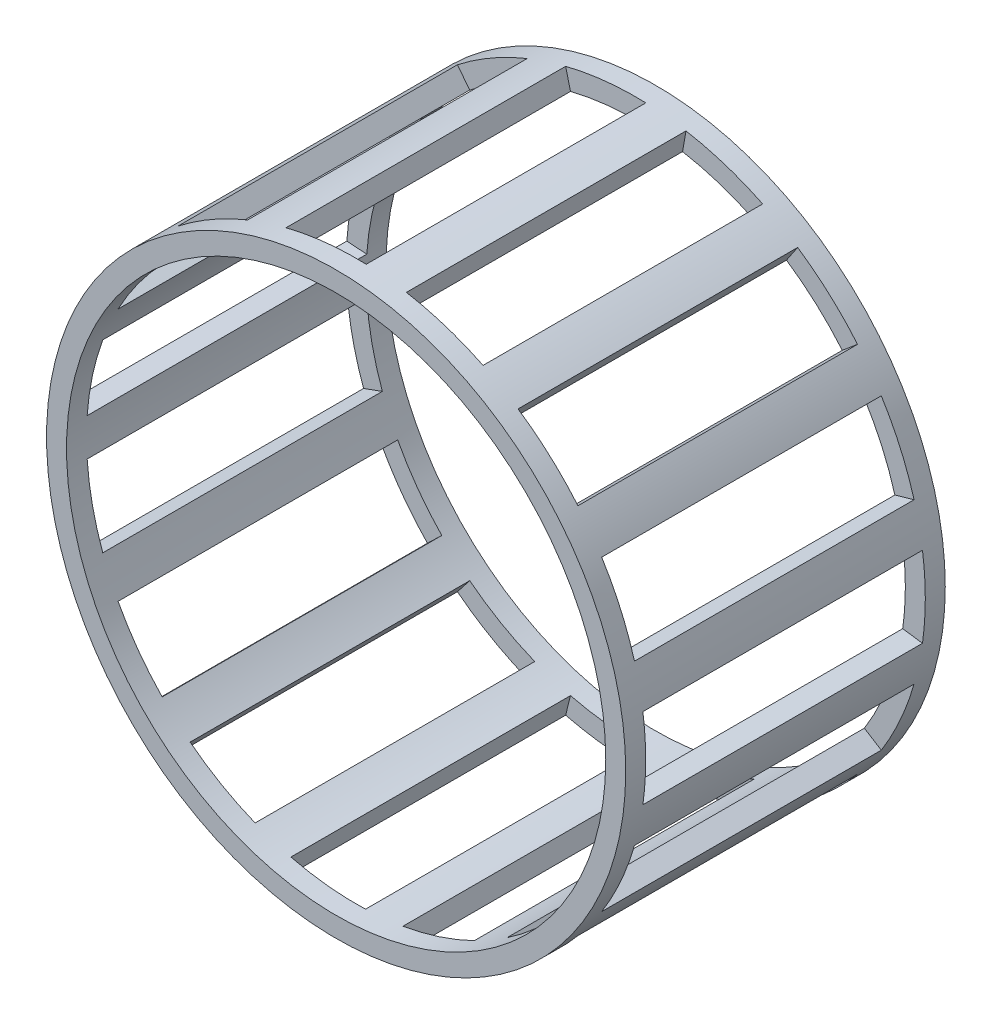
ISO-10303-21;
HEADER;
FILE_DESCRIPTION(('STEP AP214'),'2;1');
FILE_NAME('part.step','',(''),(''),'','','');
FILE_SCHEMA(('AUTOMOTIVE_DESIGN { 1 0 10303 214 1 1 1 1 }'));
ENDSEC;
DATA;
#1=APPLICATION_CONTEXT('core data for automotive mechanical design processes');
#2=APPLICATION_PROTOCOL_DEFINITION('international standard','automotive_design',2000,#1);
#3=PRODUCT_CONTEXT('',#1,'mechanical');
#4=PRODUCT('Part','Part','',(#3));
#5=PRODUCT_RELATED_PRODUCT_CATEGORY('part','',(#4));
#6=PRODUCT_DEFINITION_FORMATION('','',#4);
#7=PRODUCT_DEFINITION_CONTEXT('part definition',#1,'design');
#8=PRODUCT_DEFINITION('design','',#6,#7);
#9=PRODUCT_DEFINITION_SHAPE('','',#8);
#10=(LENGTH_UNIT() NAMED_UNIT(*) SI_UNIT(.MILLI.,.METRE.));
#11=(NAMED_UNIT(*) PLANE_ANGLE_UNIT() SI_UNIT($,.RADIAN.));
#12=(NAMED_UNIT(*) SI_UNIT($,.STERADIAN.) SOLID_ANGLE_UNIT());
#13=UNCERTAINTY_MEASURE_WITH_UNIT(LENGTH_MEASURE(1.E-05),#10,'distance_accuracy_value','');
#14=(GEOMETRIC_REPRESENTATION_CONTEXT(3) GLOBAL_UNCERTAINTY_ASSIGNED_CONTEXT((#13)) GLOBAL_UNIT_ASSIGNED_CONTEXT((#10,
#11,#12)) REPRESENTATION_CONTEXT('',''));
#15=CARTESIAN_POINT('',(0.,0.,0.));
#16=DIRECTION('',(0.,0.,1.));
#17=DIRECTION('',(1.,0.,0.));
#18=AXIS2_PLACEMENT_3D('',#15,#16,#17);
#19=CARTESIAN_POINT('',(0.,0.,4.));
#20=DIRECTION('',(0.,0.,1.));
#21=DIRECTION('',(1.,0.,0.));
#22=AXIS2_PLACEMENT_3D('',#19,#20,#21);
#23=PLANE('',#22);
#24=CARTESIAN_POINT('',(0.,0.,4.));
#25=DIRECTION('',(0.,0.,1.));
#26=DIRECTION('',(1.,0.,0.));
#27=AXIS2_PLACEMENT_3D('',#24,#25,#26);
#28=CIRCLE('',#27,7.25);
#29=CARTESIAN_POINT('',(7.25,0.,4.));
#30=VERTEX_POINT('',#29);
#31=EDGE_CURVE('E883',#30,#30,#28,.T.);
#32=ORIENTED_EDGE('',*,*,#31,.T.);
#33=EDGE_LOOP('',(#32));
#34=FACE_BOUND('',#33,.T.);
#35=CARTESIAN_POINT('',(0.,0.,4.));
#36=DIRECTION('',(0.,0.,1.));
#37=DIRECTION('',(1.,0.,0.));
#38=AXIS2_PLACEMENT_3D('',#35,#36,#37);
#39=CIRCLE('',#38,6.75);
#40=CARTESIAN_POINT('',(6.75,0.,4.));
#41=VERTEX_POINT('',#40);
#42=EDGE_CURVE('E889',#41,#41,#39,.T.);
#43=ORIENTED_EDGE('',*,*,#42,.F.);
#44=EDGE_LOOP('',(#43));
#45=FACE_BOUND('',#44,.T.);
#46=ADVANCED_FACE('F350',(#34,#45),#23,.T.);
#47=CARTESIAN_POINT('',(0.,0.,-4.));
#48=DIRECTION('',(0.,0.,1.));
#49=DIRECTION('',(1.,0.,0.));
#50=AXIS2_PLACEMENT_3D('',#47,#48,#49);
#51=PLANE('',#50);
#52=CARTESIAN_POINT('',(0.,0.,-4.));
#53=DIRECTION('',(0.,0.,1.));
#54=DIRECTION('',(1.,0.,0.));
#55=AXIS2_PLACEMENT_3D('',#52,#53,#54);
#56=CIRCLE('',#55,7.25);
#57=CARTESIAN_POINT('',(7.25,0.,-4.));
#58=VERTEX_POINT('',#57);
#59=EDGE_CURVE('E886',#58,#58,#56,.T.);
#60=ORIENTED_EDGE('',*,*,#59,.F.);
#61=EDGE_LOOP('',(#60));
#62=FACE_BOUND('',#61,.T.);
#63=CARTESIAN_POINT('',(0.,0.,-4.));
#64=DIRECTION('',(0.,0.,1.));
#65=DIRECTION('',(1.,0.,0.));
#66=AXIS2_PLACEMENT_3D('',#63,#64,#65);
#67=CIRCLE('',#66,6.75);
#68=CARTESIAN_POINT('',(6.75,0.,-4.));
#69=VERTEX_POINT('',#68);
#70=EDGE_CURVE('E892',#69,#69,#67,.T.);
#71=ORIENTED_EDGE('',*,*,#70,.T.);
#72=EDGE_LOOP('',(#71));
#73=FACE_BOUND('',#72,.T.);
#74=ADVANCED_FACE('F1247',(#62,#73),#51,.F.);
#75=CARTESIAN_POINT('',(0.,0.,4.));
#76=DIRECTION('',(0.,0.,-1.));
#77=DIRECTION('',(-1.,0.,0.));
#78=AXIS2_PLACEMENT_3D('',#75,#76,#77);
#79=CYLINDRICAL_SURFACE('',#78,7.25);
#80=CARTESIAN_POINT('',(0.,0.,-3.5));
#81=DIRECTION('',(0.,0.,-1.));
#82=DIRECTION('',(-1.,0.,0.));
#83=AXIS2_PLACEMENT_3D('',#80,#81,#82);
#84=CIRCLE('',#83,7.25);
#85=CARTESIAN_POINT('',(6.14834869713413,3.84191466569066,-3.5));
#86=VERTEX_POINT('',#85);
#87=CARTESIAN_POINT('',(6.96914729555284,1.99837082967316,-3.5));
#88=VERTEX_POINT('',#87);
#89=EDGE_CURVE('E736',#86,#88,#84,.T.);
#90=ORIENTED_EDGE('',*,*,#89,.T.);
#91=DIRECTION('',(0.,0.,-1.));
#92=VECTOR('',#91,1.);
#93=CARTESIAN_POINT('',(6.96914729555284,1.99837082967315,4.));
#94=LINE('',#93,#92);
#95=CARTESIAN_POINT('',(6.96914729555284,1.99837082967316,3.5));
#96=VERTEX_POINT('',#95);
#97=EDGE_CURVE('E1221',#88,#96,#94,.F.);
#98=ORIENTED_EDGE('',*,*,#97,.T.);
#99=CARTESIAN_POINT('',(0.,0.,3.5));
#100=DIRECTION('',(0.,0.,1.));
#101=DIRECTION('',(1.,0.,0.));
#102=AXIS2_PLACEMENT_3D('',#99,#100,#101);
#103=CIRCLE('',#102,7.25);
#104=CARTESIAN_POINT('',(6.14834869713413,3.84191466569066,3.5));
#105=VERTEX_POINT('',#104);
#106=EDGE_CURVE('E1217',#96,#105,#103,.T.);
#107=ORIENTED_EDGE('',*,*,#106,.T.);
#108=DIRECTION('',(0.,0.,-1.));
#109=VECTOR('',#108,1.);
#110=CARTESIAN_POINT('',(6.14834869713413,3.84191466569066,4.));
#111=LINE('',#110,#109);
#112=EDGE_CURVE('E1224',#86,#105,#111,.F.);
#113=ORIENTED_EDGE('',*,*,#112,.F.);
#114=EDGE_LOOP('',(#90,#98,#107,#113));
#115=FACE_BOUND('',#114,.T.);
#116=CARTESIAN_POINT('',(0.,0.,-3.5));
#117=DIRECTION('',(0.,0.,-1.));
#118=DIRECTION('',(-1.,0.,0.));
#119=AXIS2_PLACEMENT_3D('',#116,#117,#118);
#120=CIRCLE('',#119,7.25);
#121=CARTESIAN_POINT('',(4.05414855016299,6.01052240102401,-3.5));
#122=VERTEX_POINT('',#121);
#123=CARTESIAN_POINT('',(5.55382221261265,4.66021017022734,-3.5));
#124=VERTEX_POINT('',#123);
#125=EDGE_CURVE('E1197',#122,#124,#120,.T.);
#126=ORIENTED_EDGE('',*,*,#125,.T.);
#127=DIRECTION('',(0.,0.,-1.));
#128=VECTOR('',#127,1.);
#129=CARTESIAN_POINT('',(5.55382221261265,4.66021017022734,4.));
#130=LINE('',#129,#128);
#131=CARTESIAN_POINT('',(5.55382221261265,4.66021017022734,3.5));
#132=VERTEX_POINT('',#131);
#133=EDGE_CURVE('E1200',#124,#132,#130,.F.);
#134=ORIENTED_EDGE('',*,*,#133,.T.);
#135=CARTESIAN_POINT('',(0.,0.,3.5));
#136=DIRECTION('',(0.,0.,1.));
#137=DIRECTION('',(1.,0.,0.));
#138=AXIS2_PLACEMENT_3D('',#135,#136,#137);
#139=CIRCLE('',#138,7.25);
#140=CARTESIAN_POINT('',(4.05414855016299,6.01052240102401,3.5));
#141=VERTEX_POINT('',#140);
#142=EDGE_CURVE('E1194',#132,#141,#139,.T.);
#143=ORIENTED_EDGE('',*,*,#142,.T.);
#144=DIRECTION('',(0.,0.,-1.));
#145=VECTOR('',#144,1.);
#146=CARTESIAN_POINT('',(4.05414855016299,6.01052240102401,4.));
#147=LINE('',#146,#145);
#148=EDGE_CURVE('E1203',#122,#141,#147,.F.);
#149=ORIENTED_EDGE('',*,*,#148,.F.);
#150=EDGE_LOOP('',(#126,#134,#143,#149));
#151=FACE_BOUND('',#150,.T.);
#152=CARTESIAN_POINT('',(0.,0.,-3.5));
#153=DIRECTION('',(0.,0.,-1.));
#154=DIRECTION('',(-1.,0.,0.));
#155=AXIS2_PLACEMENT_3D('',#152,#153,#154);
#156=CIRCLE('',#155,7.25);
#157=CARTESIAN_POINT('',(1.25894928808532,7.13985620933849,-3.5));
#158=VERTEX_POINT('',#157);
#159=CARTESIAN_POINT('',(3.17819081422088,6.51625683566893,-3.5));
#160=VERTEX_POINT('',#159);
#161=EDGE_CURVE('E1174',#158,#160,#156,.T.);
#162=ORIENTED_EDGE('',*,*,#161,.T.);
#163=DIRECTION('',(0.,0.,-1.));
#164=VECTOR('',#163,1.);
#165=CARTESIAN_POINT('',(3.17819081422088,6.51625683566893,4.));
#166=LINE('',#165,#164);
#167=CARTESIAN_POINT('',(3.17819081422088,6.51625683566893,3.5));
#168=VERTEX_POINT('',#167);
#169=EDGE_CURVE('E1177',#160,#168,#166,.F.);
#170=ORIENTED_EDGE('',*,*,#169,.T.);
#171=CARTESIAN_POINT('',(0.,0.,3.5));
#172=DIRECTION('',(0.,0.,1.));
#173=DIRECTION('',(1.,0.,0.));
#174=AXIS2_PLACEMENT_3D('',#171,#172,#173);
#175=CIRCLE('',#174,7.25);
#176=CARTESIAN_POINT('',(1.25894928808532,7.13985620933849,3.5));
#177=VERTEX_POINT('',#176);
#178=EDGE_CURVE('E1171',#168,#177,#175,.T.);
#179=ORIENTED_EDGE('',*,*,#178,.T.);
#180=DIRECTION('',(0.,0.,-1.));
#181=VECTOR('',#180,1.);
#182=CARTESIAN_POINT('',(1.25894928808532,7.13985620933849,4.));
#183=LINE('',#182,#181);
#184=EDGE_CURVE('E1180',#158,#177,#183,.F.);
#185=ORIENTED_EDGE('',*,*,#184,.F.);
#186=EDGE_LOOP('',(#162,#170,#179,#185));
#187=FACE_BOUND('',#186,.T.);
#188=CARTESIAN_POINT('',(0.,0.,-3.5));
#189=DIRECTION('',(0.,0.,-1.));
#190=DIRECTION('',(-1.,0.,0.));
#191=AXIS2_PLACEMENT_3D('',#188,#189,#190);
#192=CIRCLE('',#191,7.25);
#193=CARTESIAN_POINT('',(-1.75393374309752,7.03464401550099,-3.5));
#194=VERTEX_POINT('',#193);
#195=CARTESIAN_POINT('',(0.253021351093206,7.24558349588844,-3.5));
#196=VERTEX_POINT('',#195);
#197=EDGE_CURVE('E1151',#194,#196,#192,.T.);
#198=ORIENTED_EDGE('',*,*,#197,.T.);
#199=DIRECTION('',(0.,0.,-1.));
#200=VECTOR('',#199,1.);
#201=CARTESIAN_POINT('',(0.253021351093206,7.24558349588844,4.));
#202=LINE('',#201,#200);
#203=CARTESIAN_POINT('',(0.253021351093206,7.24558349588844,3.5));
#204=VERTEX_POINT('',#203);
#205=EDGE_CURVE('E1154',#196,#204,#202,.F.);
#206=ORIENTED_EDGE('',*,*,#205,.T.);
#207=CARTESIAN_POINT('',(0.,0.,3.5));
#208=DIRECTION('',(0.,0.,1.));
#209=DIRECTION('',(1.,0.,0.));
#210=AXIS2_PLACEMENT_3D('',#207,#208,#209);
#211=CIRCLE('',#210,7.25);
#212=CARTESIAN_POINT('',(-1.75393374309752,7.03464401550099,3.5));
#213=VERTEX_POINT('',#212);
#214=EDGE_CURVE('E1148',#204,#213,#211,.T.);
#215=ORIENTED_EDGE('',*,*,#214,.T.);
#216=DIRECTION('',(0.,0.,-1.));
#217=VECTOR('',#216,1.);
#218=CARTESIAN_POINT('',(-1.75393374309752,7.03464401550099,4.));
#219=LINE('',#218,#217);
#220=EDGE_CURVE('E1157',#194,#213,#219,.F.);
#221=ORIENTED_EDGE('',*,*,#220,.F.);
#222=EDGE_LOOP('',(#198,#206,#215,#221));
#223=FACE_BOUND('',#222,.T.);
#224=CARTESIAN_POINT('',(0.,0.,-3.5));
#225=DIRECTION('',(0.,0.,-1.));
#226=DIRECTION('',(-1.,0.,0.));
#227=AXIS2_PLACEMENT_3D('',#224,#225,#226);
#228=CIRCLE('',#227,7.25);
#229=CARTESIAN_POINT('',(-4.46354569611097,5.71307796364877,-3.5));
#230=VERTEX_POINT('',#229);
#231=CARTESIAN_POINT('',(-2.7158978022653,6.72208294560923,-3.5));
#232=VERTEX_POINT('',#231);
#233=EDGE_CURVE('E1128',#230,#232,#228,.T.);
#234=ORIENTED_EDGE('',*,*,#233,.T.);
#235=DIRECTION('',(0.,0.,-1.));
#236=VECTOR('',#235,1.);
#237=CARTESIAN_POINT('',(-2.7158978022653,6.72208294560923,4.));
#238=LINE('',#237,#236);
#239=CARTESIAN_POINT('',(-2.7158978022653,6.72208294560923,3.5));
#240=VERTEX_POINT('',#239);
#241=EDGE_CURVE('E1131',#232,#240,#238,.F.);
#242=ORIENTED_EDGE('',*,*,#241,.T.);
#243=CARTESIAN_POINT('',(0.,0.,3.5));
#244=DIRECTION('',(0.,0.,1.));
#245=DIRECTION('',(1.,0.,0.));
#246=AXIS2_PLACEMENT_3D('',#243,#244,#245);
#247=CIRCLE('',#246,7.25);
#248=CARTESIAN_POINT('',(-4.46354569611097,5.71307796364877,3.5));
#249=VERTEX_POINT('',#248);
#250=EDGE_CURVE('E1125',#240,#249,#247,.T.);
#251=ORIENTED_EDGE('',*,*,#250,.T.);
#252=DIRECTION('',(0.,0.,-1.));
#253=VECTOR('',#252,1.);
#254=CARTESIAN_POINT('',(-4.46354569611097,5.71307796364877,4.));
#255=LINE('',#254,#253);
#256=EDGE_CURVE('E1134',#230,#249,#255,.F.);
#257=ORIENTED_EDGE('',*,*,#256,.F.);
#258=EDGE_LOOP('',(#234,#242,#251,#257));
#259=FACE_BOUND('',#258,.T.);
#260=CARTESIAN_POINT('',(0.,0.,-3.5));
#261=DIRECTION('',(0.,0.,-1.));
#262=DIRECTION('',(-1.,0.,0.));
#263=AXIS2_PLACEMENT_3D('',#260,#261,#262);
#264=CIRCLE('',#263,7.25);
#265=CARTESIAN_POINT('',(-6.40137004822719,3.40366883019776,-3.5));
#266=VERTEX_POINT('',#265);
#267=CARTESIAN_POINT('',(-5.21521355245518,5.03627318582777,-3.5));
#268=VERTEX_POINT('',#267);
#269=EDGE_CURVE('E1105',#266,#268,#264,.T.);
#270=ORIENTED_EDGE('',*,*,#269,.T.);
#271=DIRECTION('',(0.,0.,-1.));
#272=VECTOR('',#271,1.);
#273=CARTESIAN_POINT('',(-5.21521355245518,5.03627318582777,4.));
#274=LINE('',#273,#272);
#275=CARTESIAN_POINT('',(-5.21521355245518,5.03627318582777,3.5));
#276=VERTEX_POINT('',#275);
#277=EDGE_CURVE('E1108',#268,#276,#274,.F.);
#278=ORIENTED_EDGE('',*,*,#277,.T.);
#279=CARTESIAN_POINT('',(0.,0.,3.5));
#280=DIRECTION('',(0.,0.,1.));
#281=DIRECTION('',(1.,0.,0.));
#282=AXIS2_PLACEMENT_3D('',#279,#280,#281);
#283=CIRCLE('',#282,7.25);
#284=CARTESIAN_POINT('',(-6.40137004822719,3.40366883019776,3.5));
#285=VERTEX_POINT('',#284);
#286=EDGE_CURVE('E1102',#276,#285,#283,.T.);
#287=ORIENTED_EDGE('',*,*,#286,.T.);
#288=DIRECTION('',(0.,0.,-1.));
#289=VECTOR('',#288,1.);
#290=CARTESIAN_POINT('',(-6.40137004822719,3.40366883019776,4.));
#291=LINE('',#290,#289);
#292=EDGE_CURVE('E1111',#266,#285,#291,.F.);
#293=ORIENTED_EDGE('',*,*,#292,.F.);
#294=EDGE_LOOP('',(#270,#278,#287,#293));
#295=FACE_BOUND('',#294,.T.);
#296=CARTESIAN_POINT('',(0.,0.,-3.5));
#297=DIRECTION('',(0.,0.,-1.));
#298=DIRECTION('',(-1.,0.,0.));
#299=AXIS2_PLACEMENT_3D('',#296,#297,#298);
#300=CIRCLE('',#299,7.25);
#301=CARTESIAN_POINT('',(-7.23233936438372,0.505734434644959,-3.5));
#302=VERTEX_POINT('',#301);
#303=CARTESIAN_POINT('',(-6.81277150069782,2.47964603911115,-3.5));
#304=VERTEX_POINT('',#303);
#305=EDGE_CURVE('E1082',#302,#304,#300,.T.);
#306=ORIENTED_EDGE('',*,*,#305,.T.);
#307=DIRECTION('',(0.,0.,-1.));
#308=VECTOR('',#307,1.);
#309=CARTESIAN_POINT('',(-6.81277150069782,2.47964603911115,4.));
#310=LINE('',#309,#308);
#311=CARTESIAN_POINT('',(-6.81277150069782,2.47964603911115,3.5));
#312=VERTEX_POINT('',#311);
#313=EDGE_CURVE('E1085',#304,#312,#310,.F.);
#314=ORIENTED_EDGE('',*,*,#313,.T.);
#315=CARTESIAN_POINT('',(0.,0.,3.5));
#316=DIRECTION('',(0.,0.,1.));
#317=DIRECTION('',(1.,0.,0.));
#318=AXIS2_PLACEMENT_3D('',#315,#316,#317);
#319=CIRCLE('',#318,7.25);
#320=CARTESIAN_POINT('',(-7.23233936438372,0.505734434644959,3.5));
#321=VERTEX_POINT('',#320);
#322=EDGE_CURVE('E1079',#312,#321,#319,.T.);
#323=ORIENTED_EDGE('',*,*,#322,.T.);
#324=DIRECTION('',(0.,0.,-1.));
#325=VECTOR('',#324,1.);
#326=CARTESIAN_POINT('',(-7.23233936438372,0.505734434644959,4.));
#327=LINE('',#326,#325);
#328=EDGE_CURVE('E1088',#302,#321,#327,.F.);
#329=ORIENTED_EDGE('',*,*,#328,.F.);
#330=EDGE_LOOP('',(#306,#314,#323,#329));
#331=FACE_BOUND('',#330,.T.);
#332=CARTESIAN_POINT('',(0.,0.,-3.5));
#333=DIRECTION('',(0.,0.,-1.));
#334=DIRECTION('',(-1.,0.,0.));
#335=AXIS2_PLACEMENT_3D('',#332,#333,#334);
#336=CIRCLE('',#335,7.25);
#337=CARTESIAN_POINT('',(-6.81277150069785,-2.47964603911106,-3.5));
#338=VERTEX_POINT('',#337);
#339=CARTESIAN_POINT('',(-7.23233936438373,-0.505734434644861,-3.5));
#340=VERTEX_POINT('',#339);
#341=EDGE_CURVE('E1059',#338,#340,#336,.T.);
#342=ORIENTED_EDGE('',*,*,#341,.T.);
#343=DIRECTION('',(0.,0.,-1.));
#344=VECTOR('',#343,1.);
#345=CARTESIAN_POINT('',(-7.23233936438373,-0.505734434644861,4.));
#346=LINE('',#345,#344);
#347=CARTESIAN_POINT('',(-7.23233936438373,-0.505734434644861,3.5));
#348=VERTEX_POINT('',#347);
#349=EDGE_CURVE('E1062',#340,#348,#346,.F.);
#350=ORIENTED_EDGE('',*,*,#349,.T.);
#351=CARTESIAN_POINT('',(0.,0.,3.5));
#352=DIRECTION('',(0.,0.,1.));
#353=DIRECTION('',(1.,0.,0.));
#354=AXIS2_PLACEMENT_3D('',#351,#352,#353);
#355=CIRCLE('',#354,7.25);
#356=CARTESIAN_POINT('',(-6.81277150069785,-2.47964603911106,3.5));
#357=VERTEX_POINT('',#356);
#358=EDGE_CURVE('E1056',#348,#357,#355,.T.);
#359=ORIENTED_EDGE('',*,*,#358,.T.);
#360=DIRECTION('',(0.,0.,-1.));
#361=VECTOR('',#360,1.);
#362=CARTESIAN_POINT('',(-6.81277150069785,-2.47964603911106,4.));
#363=LINE('',#362,#361);
#364=EDGE_CURVE('E1065',#338,#357,#363,.F.);
#365=ORIENTED_EDGE('',*,*,#364,.F.);
#366=EDGE_LOOP('',(#342,#350,#359,#365));
#367=FACE_BOUND('',#366,.T.);
#368=CARTESIAN_POINT('',(0.,0.,-3.5));
#369=DIRECTION('',(0.,0.,-1.));
#370=DIRECTION('',(-1.,0.,0.));
#371=AXIS2_PLACEMENT_3D('',#368,#369,#370);
#372=CIRCLE('',#371,7.25);
#373=CARTESIAN_POINT('',(-5.21521355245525,-5.0362731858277,-3.5));
#374=VERTEX_POINT('',#373);
#375=CARTESIAN_POINT('',(-6.40137004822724,-3.40366883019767,-3.5));
#376=VERTEX_POINT('',#375);
#377=EDGE_CURVE('E1036',#374,#376,#372,.T.);
#378=ORIENTED_EDGE('',*,*,#377,.T.);
#379=DIRECTION('',(0.,0.,-1.));
#380=VECTOR('',#379,1.);
#381=CARTESIAN_POINT('',(-6.40137004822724,-3.40366883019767,4.));
#382=LINE('',#381,#380);
#383=CARTESIAN_POINT('',(-6.40137004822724,-3.40366883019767,3.5));
#384=VERTEX_POINT('',#383);
#385=EDGE_CURVE('E1039',#376,#384,#382,.F.);
#386=ORIENTED_EDGE('',*,*,#385,.T.);
#387=CARTESIAN_POINT('',(0.,0.,3.5));
#388=DIRECTION('',(0.,0.,1.));
#389=DIRECTION('',(1.,0.,0.));
#390=AXIS2_PLACEMENT_3D('',#387,#388,#389);
#391=CIRCLE('',#390,7.25);
#392=CARTESIAN_POINT('',(-5.21521355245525,-5.0362731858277,3.5));
#393=VERTEX_POINT('',#392);
#394=EDGE_CURVE('E1033',#384,#393,#391,.T.);
#395=ORIENTED_EDGE('',*,*,#394,.T.);
#396=DIRECTION('',(0.,0.,-1.));
#397=VECTOR('',#396,1.);
#398=CARTESIAN_POINT('',(-5.21521355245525,-5.0362731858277,4.));
#399=LINE('',#398,#397);
#400=EDGE_CURVE('E1042',#374,#393,#399,.F.);
#401=ORIENTED_EDGE('',*,*,#400,.F.);
#402=EDGE_LOOP('',(#378,#386,#395,#401));
#403=FACE_BOUND('',#402,.T.);
#404=CARTESIAN_POINT('',(0.,0.,-3.5));
#405=DIRECTION('',(0.,0.,-1.));
#406=DIRECTION('',(-1.,0.,0.));
#407=AXIS2_PLACEMENT_3D('',#404,#405,#406);
#408=CIRCLE('',#407,7.25);
#409=CARTESIAN_POINT('',(-2.71589780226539,-6.7220829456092,-3.5));
#410=VERTEX_POINT('',#409);
#411=CARTESIAN_POINT('',(-4.46354569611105,-5.71307796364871,-3.5));
#412=VERTEX_POINT('',#411);
#413=EDGE_CURVE('E1013',#410,#412,#408,.T.);
#414=ORIENTED_EDGE('',*,*,#413,.T.);
#415=DIRECTION('',(0.,0.,-1.));
#416=VECTOR('',#415,1.);
#417=CARTESIAN_POINT('',(-4.46354569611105,-5.71307796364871,4.));
#418=LINE('',#417,#416);
#419=CARTESIAN_POINT('',(-4.46354569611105,-5.71307796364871,3.5));
#420=VERTEX_POINT('',#419);
#421=EDGE_CURVE('E1016',#412,#420,#418,.F.);
#422=ORIENTED_EDGE('',*,*,#421,.T.);
#423=CARTESIAN_POINT('',(0.,0.,3.5));
#424=DIRECTION('',(0.,0.,1.));
#425=DIRECTION('',(1.,0.,0.));
#426=AXIS2_PLACEMENT_3D('',#423,#424,#425);
#427=CIRCLE('',#426,7.25);
#428=CARTESIAN_POINT('',(-2.71589780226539,-6.7220829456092,3.5));
#429=VERTEX_POINT('',#428);
#430=EDGE_CURVE('E1010',#420,#429,#427,.T.);
#431=ORIENTED_EDGE('',*,*,#430,.T.);
#432=DIRECTION('',(0.,0.,-1.));
#433=VECTOR('',#432,1.);
#434=CARTESIAN_POINT('',(-2.71589780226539,-6.7220829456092,4.));
#435=LINE('',#434,#433);
#436=EDGE_CURVE('E1019',#410,#429,#435,.F.);
#437=ORIENTED_EDGE('',*,*,#436,.F.);
#438=EDGE_LOOP('',(#414,#422,#431,#437));
#439=FACE_BOUND('',#438,.T.);
#440=CARTESIAN_POINT('',(0.,0.,-3.5));
#441=DIRECTION('',(0.,0.,-1.));
#442=DIRECTION('',(-1.,0.,0.));
#443=AXIS2_PLACEMENT_3D('',#440,#441,#442);
#444=CIRCLE('',#443,7.25);
#445=CARTESIAN_POINT('',(0.253021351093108,-7.24558349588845,-3.5));
#446=VERTEX_POINT('',#445);
#447=CARTESIAN_POINT('',(-1.75393374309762,-7.03464401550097,-3.5));
#448=VERTEX_POINT('',#447);
#449=EDGE_CURVE('E990',#446,#448,#444,.T.);
#450=ORIENTED_EDGE('',*,*,#449,.T.);
#451=DIRECTION('',(0.,0.,-1.));
#452=VECTOR('',#451,1.);
#453=CARTESIAN_POINT('',(-1.75393374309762,-7.03464401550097,4.));
#454=LINE('',#453,#452);
#455=CARTESIAN_POINT('',(-1.75393374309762,-7.03464401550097,3.5));
#456=VERTEX_POINT('',#455);
#457=EDGE_CURVE('E993',#448,#456,#454,.F.);
#458=ORIENTED_EDGE('',*,*,#457,.T.);
#459=CARTESIAN_POINT('',(0.,0.,3.5));
#460=DIRECTION('',(0.,0.,1.));
#461=DIRECTION('',(1.,0.,0.));
#462=AXIS2_PLACEMENT_3D('',#459,#460,#461);
#463=CIRCLE('',#462,7.25);
#464=CARTESIAN_POINT('',(0.253021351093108,-7.24558349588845,3.5));
#465=VERTEX_POINT('',#464);
#466=EDGE_CURVE('E987',#456,#465,#463,.T.);
#467=ORIENTED_EDGE('',*,*,#466,.T.);
#468=DIRECTION('',(0.,0.,-1.));
#469=VECTOR('',#468,1.);
#470=CARTESIAN_POINT('',(0.253021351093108,-7.24558349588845,4.));
#471=LINE('',#470,#469);
#472=EDGE_CURVE('E996',#446,#465,#471,.F.);
#473=ORIENTED_EDGE('',*,*,#472,.F.);
#474=EDGE_LOOP('',(#450,#458,#467,#473));
#475=FACE_BOUND('',#474,.T.);
#476=CARTESIAN_POINT('',(0.,0.,-3.5));
#477=DIRECTION('',(0.,0.,-1.));
#478=DIRECTION('',(-1.,0.,0.));
#479=AXIS2_PLACEMENT_3D('',#476,#477,#478);
#480=CIRCLE('',#479,7.25);
#481=CARTESIAN_POINT('',(3.1781908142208,-6.51625683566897,-3.5));
#482=VERTEX_POINT('',#481);
#483=CARTESIAN_POINT('',(1.25894928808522,-7.13985620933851,-3.5));
#484=VERTEX_POINT('',#483);
#485=EDGE_CURVE('E967',#482,#484,#480,.T.);
#486=ORIENTED_EDGE('',*,*,#485,.T.);
#487=DIRECTION('',(0.,0.,-1.));
#488=VECTOR('',#487,1.);
#489=CARTESIAN_POINT('',(1.25894928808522,-7.13985620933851,4.));
#490=LINE('',#489,#488);
#491=CARTESIAN_POINT('',(1.25894928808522,-7.13985620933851,3.5));
#492=VERTEX_POINT('',#491);
#493=EDGE_CURVE('E970',#484,#492,#490,.F.);
#494=ORIENTED_EDGE('',*,*,#493,.T.);
#495=CARTESIAN_POINT('',(0.,0.,3.5));
#496=DIRECTION('',(0.,0.,1.));
#497=DIRECTION('',(1.,0.,0.));
#498=AXIS2_PLACEMENT_3D('',#495,#496,#497);
#499=CIRCLE('',#498,7.25);
#500=CARTESIAN_POINT('',(3.1781908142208,-6.51625683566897,3.5));
#501=VERTEX_POINT('',#500);
#502=EDGE_CURVE('E964',#492,#501,#499,.T.);
#503=ORIENTED_EDGE('',*,*,#502,.T.);
#504=DIRECTION('',(0.,0.,-1.));
#505=VECTOR('',#504,1.);
#506=CARTESIAN_POINT('',(3.1781908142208,-6.51625683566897,4.));
#507=LINE('',#506,#505);
#508=EDGE_CURVE('E973',#482,#501,#507,.F.);
#509=ORIENTED_EDGE('',*,*,#508,.F.);
#510=EDGE_LOOP('',(#486,#494,#503,#509));
#511=FACE_BOUND('',#510,.T.);
#512=CARTESIAN_POINT('',(0.,0.,-3.5));
#513=DIRECTION('',(0.,0.,-1.));
#514=DIRECTION('',(-1.,0.,0.));
#515=AXIS2_PLACEMENT_3D('',#512,#513,#514);
#516=CIRCLE('',#515,7.25);
#517=CARTESIAN_POINT('',(5.55382221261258,-4.66021017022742,-3.5));
#518=VERTEX_POINT('',#517);
#519=CARTESIAN_POINT('',(4.0541485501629,-6.01052240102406,-3.5));
#520=VERTEX_POINT('',#519);
#521=EDGE_CURVE('E944',#518,#520,#516,.T.);
#522=ORIENTED_EDGE('',*,*,#521,.T.);
#523=DIRECTION('',(0.,0.,-1.));
#524=VECTOR('',#523,1.);
#525=CARTESIAN_POINT('',(4.0541485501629,-6.01052240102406,4.));
#526=LINE('',#525,#524);
#527=CARTESIAN_POINT('',(4.0541485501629,-6.01052240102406,3.5));
#528=VERTEX_POINT('',#527);
#529=EDGE_CURVE('E947',#520,#528,#526,.F.);
#530=ORIENTED_EDGE('',*,*,#529,.T.);
#531=CARTESIAN_POINT('',(0.,0.,3.5));
#532=DIRECTION('',(0.,0.,1.));
#533=DIRECTION('',(1.,0.,0.));
#534=AXIS2_PLACEMENT_3D('',#531,#532,#533);
#535=CIRCLE('',#534,7.25);
#536=CARTESIAN_POINT('',(5.55382221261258,-4.66021017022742,3.5));
#537=VERTEX_POINT('',#536);
#538=EDGE_CURVE('E941',#528,#537,#535,.T.);
#539=ORIENTED_EDGE('',*,*,#538,.T.);
#540=DIRECTION('',(0.,0.,-1.));
#541=VECTOR('',#540,1.);
#542=CARTESIAN_POINT('',(5.55382221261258,-4.66021017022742,4.));
#543=LINE('',#542,#541);
#544=EDGE_CURVE('E950',#518,#537,#543,.F.);
#545=ORIENTED_EDGE('',*,*,#544,.F.);
#546=EDGE_LOOP('',(#522,#530,#539,#545));
#547=FACE_BOUND('',#546,.T.);
#548=CARTESIAN_POINT('',(0.,0.,-3.5));
#549=DIRECTION('',(0.,0.,-1.));
#550=DIRECTION('',(-1.,0.,0.));
#551=AXIS2_PLACEMENT_3D('',#548,#549,#550);
#552=CIRCLE('',#551,7.25);
#553=CARTESIAN_POINT('',(6.96914729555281,-1.99837082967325,-3.5));
#554=VERTEX_POINT('',#553);
#555=CARTESIAN_POINT('',(6.14834869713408,-3.84191466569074,-3.5));
#556=VERTEX_POINT('',#555);
#557=EDGE_CURVE('E921',#554,#556,#552,.T.);
#558=ORIENTED_EDGE('',*,*,#557,.T.);
#559=DIRECTION('',(0.,0.,-1.));
#560=VECTOR('',#559,1.);
#561=CARTESIAN_POINT('',(6.14834869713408,-3.84191466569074,4.));
#562=LINE('',#561,#560);
#563=CARTESIAN_POINT('',(6.14834869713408,-3.84191466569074,3.5));
#564=VERTEX_POINT('',#563);
#565=EDGE_CURVE('E924',#556,#564,#562,.F.);
#566=ORIENTED_EDGE('',*,*,#565,.T.);
#567=CARTESIAN_POINT('',(0.,0.,3.5));
#568=DIRECTION('',(0.,0.,1.));
#569=DIRECTION('',(1.,0.,0.));
#570=AXIS2_PLACEMENT_3D('',#567,#568,#569);
#571=CIRCLE('',#570,7.25);
#572=CARTESIAN_POINT('',(6.96914729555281,-1.99837082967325,3.5));
#573=VERTEX_POINT('',#572);
#574=EDGE_CURVE('E918',#564,#573,#571,.T.);
#575=ORIENTED_EDGE('',*,*,#574,.T.);
#576=DIRECTION('',(0.,0.,-1.));
#577=VECTOR('',#576,1.);
#578=CARTESIAN_POINT('',(6.96914729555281,-1.99837082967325,4.));
#579=LINE('',#578,#577);
#580=EDGE_CURVE('E927',#554,#573,#579,.F.);
#581=ORIENTED_EDGE('',*,*,#580,.F.);
#582=EDGE_LOOP('',(#558,#566,#575,#581));
#583=FACE_BOUND('',#582,.T.);
#584=CARTESIAN_POINT('',(0.,0.,-3.5));
#585=DIRECTION('',(0.,0.,-1.));
#586=DIRECTION('',(-1.,0.,0.));
#587=AXIS2_PLACEMENT_3D('',#584,#585,#586);
#588=CIRCLE('',#587,7.25);
#589=CARTESIAN_POINT('',(7.17944349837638,1.00900498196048,-3.5));
#590=VERTEX_POINT('',#589);
#591=CARTESIAN_POINT('',(7.17944349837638,-1.00900498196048,-3.5));
#592=VERTEX_POINT('',#591);
#593=EDGE_CURVE('E898',#590,#592,#588,.T.);
#594=ORIENTED_EDGE('',*,*,#593,.T.);
#595=DIRECTION('',(0.,0.,-1.));
#596=VECTOR('',#595,1.);
#597=CARTESIAN_POINT('',(7.17944349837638,-1.00900498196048,4.));
#598=LINE('',#597,#596);
#599=CARTESIAN_POINT('',(7.17944349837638,-1.00900498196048,3.5));
#600=VERTEX_POINT('',#599);
#601=EDGE_CURVE('E901',#592,#600,#598,.F.);
#602=ORIENTED_EDGE('',*,*,#601,.T.);
#603=CARTESIAN_POINT('',(0.,0.,3.5));
#604=DIRECTION('',(0.,0.,1.));
#605=DIRECTION('',(1.,0.,0.));
#606=AXIS2_PLACEMENT_3D('',#603,#604,#605);
#607=CIRCLE('',#606,7.25);
#608=CARTESIAN_POINT('',(7.17944349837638,1.00900498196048,3.5));
#609=VERTEX_POINT('',#608);
#610=EDGE_CURVE('E895',#600,#609,#607,.T.);
#611=ORIENTED_EDGE('',*,*,#610,.T.);
#612=DIRECTION('',(0.,0.,-1.));
#613=VECTOR('',#612,1.);
#614=CARTESIAN_POINT('',(7.17944349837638,1.00900498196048,4.));
#615=LINE('',#614,#613);
#616=EDGE_CURVE('E904',#590,#609,#615,.F.);
#617=ORIENTED_EDGE('',*,*,#616,.F.);
#618=EDGE_LOOP('',(#594,#602,#611,#617));
#619=FACE_BOUND('',#618,.T.);
#620=ORIENTED_EDGE('',*,*,#31,.F.);
#621=EDGE_LOOP('',(#620));
#622=FACE_BOUND('',#621,.T.);
#623=ORIENTED_EDGE('',*,*,#59,.T.);
#624=EDGE_LOOP('',(#623));
#625=FACE_BOUND('',#624,.T.);
#626=ADVANCED_FACE('F352',(#115,#151,#187,#223,#259,#295,#331,#367,#403,#439,#475,#511,#547,
#583,#619,#622,#625),#79,.T.);
#627=CARTESIAN_POINT('',(0.,0.,4.));
#628=DIRECTION('',(0.,0.,-1.));
#629=DIRECTION('',(-1.,0.,0.));
#630=AXIS2_PLACEMENT_3D('',#627,#628,#629);
#631=CYLINDRICAL_SURFACE('',#630,6.75);
#632=DIRECTION('',(0.,0.,-1.));
#633=VECTOR('',#632,1.);
#634=CARTESIAN_POINT('',(6.48851644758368,1.86055215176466,4.));
#635=LINE('',#634,#633);
#636=CARTESIAN_POINT('',(6.48851644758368,1.86055215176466,-3.5));
#637=VERTEX_POINT('',#636);
#638=CARTESIAN_POINT('',(6.48851644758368,1.86055215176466,3.5));
#639=VERTEX_POINT('',#638);
#640=EDGE_CURVE('E11',#637,#639,#635,.F.);
#641=ORIENTED_EDGE('',*,*,#640,.F.);
#642=CARTESIAN_POINT('',(0.,0.,-3.5));
#643=DIRECTION('',(0.,0.,-1.));
#644=DIRECTION('',(-1.,0.,0.));
#645=AXIS2_PLACEMENT_3D('',#642,#643,#644);
#646=CIRCLE('',#645,6.75);
#647=CARTESIAN_POINT('',(5.72432464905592,3.57695503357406,-3.5));
#648=VERTEX_POINT('',#647);
#649=EDGE_CURVE('E728',#648,#637,#646,.T.);
#650=ORIENTED_EDGE('',*,*,#649,.F.);
#651=DIRECTION('',(0.,0.,-1.));
#652=VECTOR('',#651,1.);
#653=CARTESIAN_POINT('',(5.72432464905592,3.57695503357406,4.));
#654=LINE('',#653,#652);
#655=CARTESIAN_POINT('',(5.72432464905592,3.57695503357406,3.5));
#656=VERTEX_POINT('',#655);
#657=EDGE_CURVE('E723',#648,#656,#654,.F.);
#658=ORIENTED_EDGE('',*,*,#657,.T.);
#659=CARTESIAN_POINT('',(0.,0.,3.5));
#660=DIRECTION('',(0.,0.,1.));
#661=DIRECTION('',(1.,0.,0.));
#662=AXIS2_PLACEMENT_3D('',#659,#660,#661);
#663=CIRCLE('',#662,6.75);
#664=EDGE_CURVE('E358',#639,#656,#663,.T.);
#665=ORIENTED_EDGE('',*,*,#664,.F.);
#666=EDGE_LOOP('',(#641,#650,#658,#665));
#667=FACE_BOUND('',#666,.T.);
#668=DIRECTION('',(0.,0.,-1.));
#669=VECTOR('',#668,1.);
#670=CARTESIAN_POINT('',(5.17079999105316,4.33881636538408,4.));
#671=LINE('',#670,#669);
#672=CARTESIAN_POINT('',(5.17079999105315,4.33881636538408,-3.5));
#673=VERTEX_POINT('',#672);
#674=CARTESIAN_POINT('',(5.17079999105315,4.33881636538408,3.5));
#675=VERTEX_POINT('',#674);
#676=EDGE_CURVE('E729',#673,#675,#671,.F.);
#677=ORIENTED_EDGE('',*,*,#676,.F.);
#678=CARTESIAN_POINT('',(0.,0.,-3.5));
#679=DIRECTION('',(0.,0.,-1.));
#680=DIRECTION('',(-1.,0.,0.));
#681=AXIS2_PLACEMENT_3D('',#678,#679,#680);
#682=CIRCLE('',#681,6.75);
#683=CARTESIAN_POINT('',(3.77455209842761,5.59600361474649,-3.5));
#684=VERTEX_POINT('',#683);
#685=EDGE_CURVE('E748',#684,#673,#682,.T.);
#686=ORIENTED_EDGE('',*,*,#685,.F.);
#687=DIRECTION('',(0.,0.,-1.));
#688=VECTOR('',#687,1.);
#689=CARTESIAN_POINT('',(3.77455209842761,5.59600361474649,4.));
#690=LINE('',#689,#688);
#691=CARTESIAN_POINT('',(3.77455209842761,5.59600361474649,3.5));
#692=VERTEX_POINT('',#691);
#693=EDGE_CURVE('E750',#684,#692,#690,.F.);
#694=ORIENTED_EDGE('',*,*,#693,.T.);
#695=CARTESIAN_POINT('',(0.,0.,3.5));
#696=DIRECTION('',(0.,0.,1.));
#697=DIRECTION('',(1.,0.,0.));
#698=AXIS2_PLACEMENT_3D('',#695,#696,#697);
#699=CIRCLE('',#698,6.75);
#700=EDGE_CURVE('E745',#675,#692,#699,.T.);
#701=ORIENTED_EDGE('',*,*,#700,.F.);
#702=EDGE_LOOP('',(#677,#686,#694,#701));
#703=FACE_BOUND('',#702,.T.);
#704=DIRECTION('',(0.,0.,-1.));
#705=VECTOR('',#704,1.);
#706=CARTESIAN_POINT('',(2.95900524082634,6.06685981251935,4.));
#707=LINE('',#706,#705);
#708=CARTESIAN_POINT('',(2.95900524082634,6.06685981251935,-3.5));
#709=VERTEX_POINT('',#708);
#710=CARTESIAN_POINT('',(2.95900524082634,6.06685981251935,3.5));
#711=VERTEX_POINT('',#710);
#712=EDGE_CURVE('E753',#709,#711,#707,.F.);
#713=ORIENTED_EDGE('',*,*,#712,.F.);
#714=CARTESIAN_POINT('',(0.,0.,-3.5));
#715=DIRECTION('',(0.,0.,-1.));
#716=DIRECTION('',(-1.,0.,0.));
#717=AXIS2_PLACEMENT_3D('',#714,#715,#716);
#718=CIRCLE('',#717,6.75);
#719=CARTESIAN_POINT('',(1.17212519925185,6.64745233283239,-3.5));
#720=VERTEX_POINT('',#719);
#721=EDGE_CURVE('E758',#720,#709,#718,.T.);
#722=ORIENTED_EDGE('',*,*,#721,.F.);
#723=DIRECTION('',(0.,0.,-1.));
#724=VECTOR('',#723,1.);
#725=CARTESIAN_POINT('',(1.17212519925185,6.64745233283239,4.));
#726=LINE('',#725,#724);
#727=CARTESIAN_POINT('',(1.17212519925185,6.64745233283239,3.5));
#728=VERTEX_POINT('',#727);
#729=EDGE_CURVE('E760',#720,#728,#726,.F.);
#730=ORIENTED_EDGE('',*,*,#729,.T.);
#731=CARTESIAN_POINT('',(0.,0.,3.5));
#732=DIRECTION('',(0.,0.,1.));
#733=DIRECTION('',(1.,0.,0.));
#734=AXIS2_PLACEMENT_3D('',#731,#732,#733);
#735=CIRCLE('',#734,6.75);
#736=EDGE_CURVE('E755',#711,#728,#735,.T.);
#737=ORIENTED_EDGE('',*,*,#736,.F.);
#738=EDGE_LOOP('',(#713,#722,#730,#737));
#739=FACE_BOUND('',#738,.T.);
#740=DIRECTION('',(0.,0.,-1.));
#741=VECTOR('',#740,1.);
#742=CARTESIAN_POINT('',(0.23557160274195,6.74588808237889,4.));
#743=LINE('',#742,#741);
#744=CARTESIAN_POINT('',(0.23557160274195,6.74588808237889,-3.5));
#745=VERTEX_POINT('',#744);
#746=CARTESIAN_POINT('',(0.23557160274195,6.74588808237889,3.5));
#747=VERTEX_POINT('',#746);
#748=EDGE_CURVE('E763',#745,#747,#743,.F.);
#749=ORIENTED_EDGE('',*,*,#748,.F.);
#750=CARTESIAN_POINT('',(0.,0.,-3.5));
#751=DIRECTION('',(0.,0.,-1.));
#752=DIRECTION('',(-1.,0.,0.));
#753=AXIS2_PLACEMENT_3D('',#750,#751,#752);
#754=CIRCLE('',#753,6.75);
#755=CARTESIAN_POINT('',(-1.63297279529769,6.54949615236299,-3.5));
#756=VERTEX_POINT('',#755);
#757=EDGE_CURVE('E768',#756,#745,#754,.T.);
#758=ORIENTED_EDGE('',*,*,#757,.F.);
#759=DIRECTION('',(0.,0.,-1.));
#760=VECTOR('',#759,1.);
#761=CARTESIAN_POINT('',(-1.63297279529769,6.54949615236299,4.));
#762=LINE('',#761,#760);
#763=CARTESIAN_POINT('',(-1.63297279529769,6.54949615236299,3.5));
#764=VERTEX_POINT('',#763);
#765=EDGE_CURVE('E770',#756,#764,#762,.F.);
#766=ORIENTED_EDGE('',*,*,#765,.T.);
#767=CARTESIAN_POINT('',(0.,0.,3.5));
#768=DIRECTION('',(0.,0.,1.));
#769=DIRECTION('',(1.,0.,0.));
#770=AXIS2_PLACEMENT_3D('',#767,#768,#769);
#771=CIRCLE('',#770,6.75);
#772=EDGE_CURVE('E765',#747,#764,#771,.T.);
#773=ORIENTED_EDGE('',*,*,#772,.F.);
#774=EDGE_LOOP('',(#749,#758,#766,#773));
#775=FACE_BOUND('',#774,.T.);
#776=DIRECTION('',(0.,0.,-1.));
#777=VECTOR('',#776,1.);
#778=CARTESIAN_POINT('',(-2.52859450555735,6.25849101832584,4.));
#779=LINE('',#778,#777);
#780=CARTESIAN_POINT('',(-2.52859450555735,6.25849101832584,-3.5));
#781=VERTEX_POINT('',#780);
#782=CARTESIAN_POINT('',(-2.52859450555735,6.25849101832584,3.5));
#783=VERTEX_POINT('',#782);
#784=EDGE_CURVE('E773',#781,#783,#779,.F.);
#785=ORIENTED_EDGE('',*,*,#784,.F.);
#786=CARTESIAN_POINT('',(0.,0.,-3.5));
#787=DIRECTION('',(0.,0.,-1.));
#788=DIRECTION('',(-1.,0.,0.));
#789=AXIS2_PLACEMENT_3D('',#786,#787,#788);
#790=CIRCLE('',#789,6.75);
#791=CARTESIAN_POINT('',(-4.15571495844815,5.31907258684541,-3.5));
#792=VERTEX_POINT('',#791);
#793=EDGE_CURVE('E778',#792,#781,#790,.T.);
#794=ORIENTED_EDGE('',*,*,#793,.F.);
#795=DIRECTION('',(0.,0.,-1.));
#796=VECTOR('',#795,1.);
#797=CARTESIAN_POINT('',(-4.15571495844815,5.31907258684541,4.));
#798=LINE('',#797,#796);
#799=CARTESIAN_POINT('',(-4.15571495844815,5.31907258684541,3.5));
#800=VERTEX_POINT('',#799);
#801=EDGE_CURVE('E780',#792,#800,#798,.F.);
#802=ORIENTED_EDGE('',*,*,#801,.T.);
#803=CARTESIAN_POINT('',(0.,0.,3.5));
#804=DIRECTION('',(0.,0.,1.));
#805=DIRECTION('',(1.,0.,0.));
#806=AXIS2_PLACEMENT_3D('',#803,#804,#805);
#807=CIRCLE('',#806,6.75);
#808=EDGE_CURVE('E775',#783,#800,#807,.T.);
#809=ORIENTED_EDGE('',*,*,#808,.F.);
#810=EDGE_LOOP('',(#785,#794,#802,#809));
#811=FACE_BOUND('',#810,.T.);
#812=DIRECTION('',(0.,0.,-1.));
#813=VECTOR('',#812,1.);
#814=CARTESIAN_POINT('',(-4.85554365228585,4.68894400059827,4.));
#815=LINE('',#814,#813);
#816=CARTESIAN_POINT('',(-4.85554365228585,4.68894400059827,-3.5));
#817=VERTEX_POINT('',#816);
#818=CARTESIAN_POINT('',(-4.85554365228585,4.68894400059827,3.5));
#819=VERTEX_POINT('',#818);
#820=EDGE_CURVE('E783',#817,#819,#815,.F.);
#821=ORIENTED_EDGE('',*,*,#820,.F.);
#822=CARTESIAN_POINT('',(0.,0.,-3.5));
#823=DIRECTION('',(0.,0.,-1.));
#824=DIRECTION('',(-1.,0.,0.));
#825=AXIS2_PLACEMENT_3D('',#822,#823,#824);
#826=CIRCLE('',#825,6.75);
#827=CARTESIAN_POINT('',(-5.95989625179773,3.16893304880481,-3.5));
#828=VERTEX_POINT('',#827);
#829=EDGE_CURVE('E788',#828,#817,#826,.T.);
#830=ORIENTED_EDGE('',*,*,#829,.F.);
#831=DIRECTION('',(0.,0.,-1.));
#832=VECTOR('',#831,1.);
#833=CARTESIAN_POINT('',(-5.95989625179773,3.16893304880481,4.));
#834=LINE('',#833,#832);
#835=CARTESIAN_POINT('',(-5.95989625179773,3.16893304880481,3.5));
#836=VERTEX_POINT('',#835);
#837=EDGE_CURVE('E790',#828,#836,#834,.F.);
#838=ORIENTED_EDGE('',*,*,#837,.T.);
#839=CARTESIAN_POINT('',(0.,0.,3.5));
#840=DIRECTION('',(0.,0.,1.));
#841=DIRECTION('',(1.,0.,0.));
#842=AXIS2_PLACEMENT_3D('',#839,#840,#841);
#843=CIRCLE('',#842,6.75);
#844=EDGE_CURVE('E785',#819,#836,#843,.T.);
#845=ORIENTED_EDGE('',*,*,#844,.F.);
#846=EDGE_LOOP('',(#821,#830,#838,#845));
#847=FACE_BOUND('',#846,.T.);
#848=DIRECTION('',(0.,0.,-1.));
#849=VECTOR('',#848,1.);
#850=CARTESIAN_POINT('',(-6.34292519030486,2.30863596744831,4.));
#851=LINE('',#850,#849);
#852=CARTESIAN_POINT('',(-6.34292519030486,2.30863596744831,-3.5));
#853=VERTEX_POINT('',#852);
#854=CARTESIAN_POINT('',(-6.34292519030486,2.30863596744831,3.5));
#855=VERTEX_POINT('',#854);
#856=EDGE_CURVE('E793',#853,#855,#851,.F.);
#857=ORIENTED_EDGE('',*,*,#856,.F.);
#858=CARTESIAN_POINT('',(0.,0.,-3.5));
#859=DIRECTION('',(0.,0.,-1.));
#860=DIRECTION('',(-1.,0.,0.));
#861=AXIS2_PLACEMENT_3D('',#858,#859,#860);
#862=CIRCLE('',#861,6.75);
#863=CARTESIAN_POINT('',(-6.73355733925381,0.470856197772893,-3.5));
#864=VERTEX_POINT('',#863);
#865=EDGE_CURVE('E798',#864,#853,#862,.T.);
#866=ORIENTED_EDGE('',*,*,#865,.F.);
#867=DIRECTION('',(0.,0.,-1.));
#868=VECTOR('',#867,1.);
#869=CARTESIAN_POINT('',(-6.73355733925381,0.470856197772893,4.));
#870=LINE('',#869,#868);
#871=CARTESIAN_POINT('',(-6.73355733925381,0.470856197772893,3.5));
#872=VERTEX_POINT('',#871);
#873=EDGE_CURVE('E800',#864,#872,#870,.F.);
#874=ORIENTED_EDGE('',*,*,#873,.T.);
#875=CARTESIAN_POINT('',(0.,0.,3.5));
#876=DIRECTION('',(0.,0.,1.));
#877=DIRECTION('',(1.,0.,0.));
#878=AXIS2_PLACEMENT_3D('',#875,#876,#877);
#879=CIRCLE('',#878,6.75);
#880=EDGE_CURVE('E795',#855,#872,#879,.T.);
#881=ORIENTED_EDGE('',*,*,#880,.F.);
#882=EDGE_LOOP('',(#857,#866,#874,#881));
#883=FACE_BOUND('',#882,.T.);
#884=DIRECTION('',(0.,0.,-1.));
#885=VECTOR('',#884,1.);
#886=CARTESIAN_POINT('',(-6.73355733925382,-0.470856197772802,4.));
#887=LINE('',#886,#885);
#888=CARTESIAN_POINT('',(-6.73355733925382,-0.470856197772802,-3.5));
#889=VERTEX_POINT('',#888);
#890=CARTESIAN_POINT('',(-6.73355733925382,-0.470856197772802,3.5));
#891=VERTEX_POINT('',#890);
#892=EDGE_CURVE('E803',#889,#891,#887,.F.);
#893=ORIENTED_EDGE('',*,*,#892,.F.);
#894=CARTESIAN_POINT('',(0.,0.,-3.5));
#895=DIRECTION('',(0.,0.,-1.));
#896=DIRECTION('',(-1.,0.,0.));
#897=AXIS2_PLACEMENT_3D('',#894,#895,#896);
#898=CIRCLE('',#897,6.75);
#899=CARTESIAN_POINT('',(-6.3429251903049,-2.30863596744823,-3.5));
#900=VERTEX_POINT('',#899);
#901=EDGE_CURVE('E808',#900,#889,#898,.T.);
#902=ORIENTED_EDGE('',*,*,#901,.F.);
#903=DIRECTION('',(0.,0.,-1.));
#904=VECTOR('',#903,1.);
#905=CARTESIAN_POINT('',(-6.3429251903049,-2.30863596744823,4.));
#906=LINE('',#905,#904);
#907=CARTESIAN_POINT('',(-6.3429251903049,-2.30863596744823,3.5));
#908=VERTEX_POINT('',#907);
#909=EDGE_CURVE('E810',#900,#908,#906,.F.);
#910=ORIENTED_EDGE('',*,*,#909,.T.);
#911=CARTESIAN_POINT('',(0.,0.,3.5));
#912=DIRECTION('',(0.,0.,1.));
#913=DIRECTION('',(1.,0.,0.));
#914=AXIS2_PLACEMENT_3D('',#911,#912,#913);
#915=CIRCLE('',#914,6.75);
#916=EDGE_CURVE('E805',#891,#908,#915,.T.);
#917=ORIENTED_EDGE('',*,*,#916,.F.);
#918=EDGE_LOOP('',(#893,#902,#910,#917));
#919=FACE_BOUND('',#918,.T.);
#920=DIRECTION('',(0.,0.,-1.));
#921=VECTOR('',#920,1.);
#922=CARTESIAN_POINT('',(-5.95989625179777,-3.16893304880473,4.));
#923=LINE('',#922,#921);
#924=CARTESIAN_POINT('',(-5.95989625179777,-3.16893304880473,-3.5));
#925=VERTEX_POINT('',#924);
#926=CARTESIAN_POINT('',(-5.95989625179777,-3.16893304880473,3.5));
#927=VERTEX_POINT('',#926);
#928=EDGE_CURVE('E813',#925,#927,#923,.F.);
#929=ORIENTED_EDGE('',*,*,#928,.F.);
#930=CARTESIAN_POINT('',(0.,0.,-3.5));
#931=DIRECTION('',(0.,0.,-1.));
#932=DIRECTION('',(-1.,0.,0.));
#933=AXIS2_PLACEMENT_3D('',#930,#931,#932);
#934=CIRCLE('',#933,6.75);
#935=CARTESIAN_POINT('',(-4.85554365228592,-4.68894400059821,-3.5));
#936=VERTEX_POINT('',#935);
#937=EDGE_CURVE('E818',#936,#925,#934,.T.);
#938=ORIENTED_EDGE('',*,*,#937,.F.);
#939=DIRECTION('',(0.,0.,-1.));
#940=VECTOR('',#939,1.);
#941=CARTESIAN_POINT('',(-4.85554365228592,-4.68894400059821,4.));
#942=LINE('',#941,#940);
#943=CARTESIAN_POINT('',(-4.85554365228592,-4.68894400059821,3.5));
#944=VERTEX_POINT('',#943);
#945=EDGE_CURVE('E820',#936,#944,#942,.F.);
#946=ORIENTED_EDGE('',*,*,#945,.T.);
#947=CARTESIAN_POINT('',(0.,0.,3.5));
#948=DIRECTION('',(0.,0.,1.));
#949=DIRECTION('',(1.,0.,0.));
#950=AXIS2_PLACEMENT_3D('',#947,#948,#949);
#951=CIRCLE('',#950,6.75);
#952=EDGE_CURVE('E815',#927,#944,#951,.T.);
#953=ORIENTED_EDGE('',*,*,#952,.F.);
#954=EDGE_LOOP('',(#929,#938,#946,#953));
#955=FACE_BOUND('',#954,.T.);
#956=DIRECTION('',(0.,0.,-1.));
#957=VECTOR('',#956,1.);
#958=CARTESIAN_POINT('',(-4.15571495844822,-5.31907258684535,4.));
#959=LINE('',#958,#957);
#960=CARTESIAN_POINT('',(-4.15571495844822,-5.31907258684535,-3.5));
#961=VERTEX_POINT('',#960);
#962=CARTESIAN_POINT('',(-4.15571495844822,-5.31907258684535,3.5));
#963=VERTEX_POINT('',#962);
#964=EDGE_CURVE('E823',#961,#963,#959,.F.);
#965=ORIENTED_EDGE('',*,*,#964,.F.);
#966=CARTESIAN_POINT('',(0.,0.,-3.5));
#967=DIRECTION('',(0.,0.,-1.));
#968=DIRECTION('',(-1.,0.,0.));
#969=AXIS2_PLACEMENT_3D('',#966,#967,#968);
#970=CIRCLE('',#969,6.75);
#971=CARTESIAN_POINT('',(-2.52859450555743,-6.2584910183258,-3.5));
#972=VERTEX_POINT('',#971);
#973=EDGE_CURVE('E828',#972,#961,#970,.T.);
#974=ORIENTED_EDGE('',*,*,#973,.F.);
#975=DIRECTION('',(0.,0.,-1.));
#976=VECTOR('',#975,1.);
#977=CARTESIAN_POINT('',(-2.52859450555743,-6.2584910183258,4.));
#978=LINE('',#977,#976);
#979=CARTESIAN_POINT('',(-2.52859450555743,-6.2584910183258,3.5));
#980=VERTEX_POINT('',#979);
#981=EDGE_CURVE('E830',#972,#980,#978,.F.);
#982=ORIENTED_EDGE('',*,*,#981,.T.);
#983=CARTESIAN_POINT('',(0.,0.,3.5));
#984=DIRECTION('',(0.,0.,1.));
#985=DIRECTION('',(1.,0.,0.));
#986=AXIS2_PLACEMENT_3D('',#983,#984,#985);
#987=CIRCLE('',#986,6.75);
#988=EDGE_CURVE('E825',#963,#980,#987,.T.);
#989=ORIENTED_EDGE('',*,*,#988,.F.);
#990=EDGE_LOOP('',(#965,#974,#982,#989));
#991=FACE_BOUND('',#990,.T.);
#992=DIRECTION('',(0.,0.,-1.));
#993=VECTOR('',#992,1.);
#994=CARTESIAN_POINT('',(-1.63297279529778,-6.54949615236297,4.));
#995=LINE('',#994,#993);
#996=CARTESIAN_POINT('',(-1.63297279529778,-6.54949615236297,-3.5));
#997=VERTEX_POINT('',#996);
#998=CARTESIAN_POINT('',(-1.63297279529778,-6.54949615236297,3.5));
#999=VERTEX_POINT('',#998);
#1000=EDGE_CURVE('E833',#997,#999,#995,.F.);
#1001=ORIENTED_EDGE('',*,*,#1000,.F.);
#1002=CARTESIAN_POINT('',(0.,0.,-3.5));
#1003=DIRECTION('',(0.,0.,-1.));
#1004=DIRECTION('',(-1.,0.,0.));
#1005=AXIS2_PLACEMENT_3D('',#1002,#1003,#1004);
#1006=CIRCLE('',#1005,6.75);
#1007=CARTESIAN_POINT('',(0.235571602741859,-6.7458880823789,-3.5));
#1008=VERTEX_POINT('',#1007);
#1009=EDGE_CURVE('E838',#1008,#997,#1006,.T.);
#1010=ORIENTED_EDGE('',*,*,#1009,.F.);
#1011=DIRECTION('',(0.,0.,-1.));
#1012=VECTOR('',#1011,1.);
#1013=CARTESIAN_POINT('',(0.235571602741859,-6.7458880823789,4.));
#1014=LINE('',#1013,#1012);
#1015=CARTESIAN_POINT('',(0.235571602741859,-6.7458880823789,3.5));
#1016=VERTEX_POINT('',#1015);
#1017=EDGE_CURVE('E840',#1008,#1016,#1014,.F.);
#1018=ORIENTED_EDGE('',*,*,#1017,.T.);
#1019=CARTESIAN_POINT('',(0.,0.,3.5));
#1020=DIRECTION('',(0.,0.,1.));
#1021=DIRECTION('',(1.,0.,0.));
#1022=AXIS2_PLACEMENT_3D('',#1019,#1020,#1021);
#1023=CIRCLE('',#1022,6.75);
#1024=EDGE_CURVE('E835',#999,#1016,#1023,.T.);
#1025=ORIENTED_EDGE('',*,*,#1024,.F.);
#1026=EDGE_LOOP('',(#1001,#1010,#1018,#1025));
#1027=FACE_BOUND('',#1026,.T.);
#1028=DIRECTION('',(0.,0.,-1.));
#1029=VECTOR('',#1028,1.);
#1030=CARTESIAN_POINT('',(1.17212519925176,-6.64745233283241,4.));
#1031=LINE('',#1030,#1029);
#1032=CARTESIAN_POINT('',(1.17212519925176,-6.64745233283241,-3.5));
#1033=VERTEX_POINT('',#1032);
#1034=CARTESIAN_POINT('',(1.17212519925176,-6.64745233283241,3.5));
#1035=VERTEX_POINT('',#1034);
#1036=EDGE_CURVE('E843',#1033,#1035,#1031,.F.);
#1037=ORIENTED_EDGE('',*,*,#1036,.F.);
#1038=CARTESIAN_POINT('',(0.,0.,-3.5));
#1039=DIRECTION('',(0.,0.,-1.));
#1040=DIRECTION('',(-1.,0.,0.));
#1041=AXIS2_PLACEMENT_3D('',#1038,#1039,#1040);
#1042=CIRCLE('',#1041,6.75);
#1043=CARTESIAN_POINT('',(2.95900524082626,-6.06685981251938,-3.5));
#1044=VERTEX_POINT('',#1043);
#1045=EDGE_CURVE('E848',#1044,#1033,#1042,.T.);
#1046=ORIENTED_EDGE('',*,*,#1045,.F.);
#1047=DIRECTION('',(0.,0.,-1.));
#1048=VECTOR('',#1047,1.);
#1049=CARTESIAN_POINT('',(2.95900524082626,-6.06685981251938,4.));
#1050=LINE('',#1049,#1048);
#1051=CARTESIAN_POINT('',(2.95900524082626,-6.06685981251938,3.5));
#1052=VERTEX_POINT('',#1051);
#1053=EDGE_CURVE('E850',#1044,#1052,#1050,.F.);
#1054=ORIENTED_EDGE('',*,*,#1053,.T.);
#1055=CARTESIAN_POINT('',(0.,0.,3.5));
#1056=DIRECTION('',(0.,0.,1.));
#1057=DIRECTION('',(1.,0.,0.));
#1058=AXIS2_PLACEMENT_3D('',#1055,#1056,#1057);
#1059=CIRCLE('',#1058,6.75);
#1060=EDGE_CURVE('E845',#1035,#1052,#1059,.T.);
#1061=ORIENTED_EDGE('',*,*,#1060,.F.);
#1062=EDGE_LOOP('',(#1037,#1046,#1054,#1061));
#1063=FACE_BOUND('',#1062,.T.);
#1064=DIRECTION('',(0.,0.,-1.));
#1065=VECTOR('',#1064,1.);
#1066=CARTESIAN_POINT('',(3.77455209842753,-5.59600361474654,4.));
#1067=LINE('',#1066,#1065);
#1068=CARTESIAN_POINT('',(3.77455209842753,-5.59600361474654,-3.5));
#1069=VERTEX_POINT('',#1068);
#1070=CARTESIAN_POINT('',(3.77455209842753,-5.59600361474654,3.5));
#1071=VERTEX_POINT('',#1070);
#1072=EDGE_CURVE('E853',#1069,#1071,#1067,.F.);
#1073=ORIENTED_EDGE('',*,*,#1072,.F.);
#1074=CARTESIAN_POINT('',(0.,0.,-3.5));
#1075=DIRECTION('',(0.,0.,-1.));
#1076=DIRECTION('',(-1.,0.,0.));
#1077=AXIS2_PLACEMENT_3D('',#1074,#1075,#1076);
#1078=CIRCLE('',#1077,6.75);
#1079=CARTESIAN_POINT('',(5.1707999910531,-4.33881636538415,-3.5));
#1080=VERTEX_POINT('',#1079);
#1081=EDGE_CURVE('E858',#1080,#1069,#1078,.T.);
#1082=ORIENTED_EDGE('',*,*,#1081,.F.);
#1083=DIRECTION('',(0.,0.,-1.));
#1084=VECTOR('',#1083,1.);
#1085=CARTESIAN_POINT('',(5.1707999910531,-4.33881636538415,4.));
#1086=LINE('',#1085,#1084);
#1087=CARTESIAN_POINT('',(5.1707999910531,-4.33881636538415,3.5));
#1088=VERTEX_POINT('',#1087);
#1089=EDGE_CURVE('E860',#1080,#1088,#1086,.F.);
#1090=ORIENTED_EDGE('',*,*,#1089,.T.);
#1091=CARTESIAN_POINT('',(0.,0.,3.5));
#1092=DIRECTION('',(0.,0.,1.));
#1093=DIRECTION('',(1.,0.,0.));
#1094=AXIS2_PLACEMENT_3D('',#1091,#1092,#1093);
#1095=CIRCLE('',#1094,6.75);
#1096=EDGE_CURVE('E855',#1071,#1088,#1095,.T.);
#1097=ORIENTED_EDGE('',*,*,#1096,.F.);
#1098=EDGE_LOOP('',(#1073,#1082,#1090,#1097));
#1099=FACE_BOUND('',#1098,.T.);
#1100=DIRECTION('',(0.,0.,-1.));
#1101=VECTOR('',#1100,1.);
#1102=CARTESIAN_POINT('',(5.72432464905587,-3.57695503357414,4.));
#1103=LINE('',#1102,#1101);
#1104=CARTESIAN_POINT('',(5.72432464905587,-3.57695503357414,-3.5));
#1105=VERTEX_POINT('',#1104);
#1106=CARTESIAN_POINT('',(5.72432464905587,-3.57695503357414,3.5));
#1107=VERTEX_POINT('',#1106);
#1108=EDGE_CURVE('E863',#1105,#1107,#1103,.F.);
#1109=ORIENTED_EDGE('',*,*,#1108,.F.);
#1110=CARTESIAN_POINT('',(0.,0.,-3.5));
#1111=DIRECTION('',(0.,0.,-1.));
#1112=DIRECTION('',(-1.,0.,0.));
#1113=AXIS2_PLACEMENT_3D('',#1110,#1111,#1112);
#1114=CIRCLE('',#1113,6.75);
#1115=CARTESIAN_POINT('',(6.48851644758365,-1.86055215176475,-3.5));
#1116=VERTEX_POINT('',#1115);
#1117=EDGE_CURVE('E868',#1116,#1105,#1114,.T.);
#1118=ORIENTED_EDGE('',*,*,#1117,.F.);
#1119=DIRECTION('',(0.,0.,-1.));
#1120=VECTOR('',#1119,1.);
#1121=CARTESIAN_POINT('',(6.48851644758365,-1.86055215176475,4.));
#1122=LINE('',#1121,#1120);
#1123=CARTESIAN_POINT('',(6.48851644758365,-1.86055215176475,3.5));
#1124=VERTEX_POINT('',#1123);
#1125=EDGE_CURVE('E870',#1116,#1124,#1122,.F.);
#1126=ORIENTED_EDGE('',*,*,#1125,.T.);
#1127=CARTESIAN_POINT('',(0.,0.,3.5));
#1128=DIRECTION('',(0.,0.,1.));
#1129=DIRECTION('',(1.,0.,0.));
#1130=AXIS2_PLACEMENT_3D('',#1127,#1128,#1129);
#1131=CIRCLE('',#1130,6.75);
#1132=EDGE_CURVE('E865',#1107,#1124,#1131,.T.);
#1133=ORIENTED_EDGE('',*,*,#1132,.F.);
#1134=EDGE_LOOP('',(#1109,#1118,#1126,#1133));
#1135=FACE_BOUND('',#1134,.T.);
#1136=DIRECTION('',(0.,0.,-1.));
#1137=VECTOR('',#1136,1.);
#1138=CARTESIAN_POINT('',(6.6843094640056,-0.939418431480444,4.));
#1139=LINE('',#1138,#1137);
#1140=CARTESIAN_POINT('',(6.6843094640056,-0.939418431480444,-3.5));
#1141=VERTEX_POINT('',#1140);
#1142=CARTESIAN_POINT('',(6.6843094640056,-0.939418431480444,3.5));
#1143=VERTEX_POINT('',#1142);
#1144=EDGE_CURVE('E873',#1141,#1143,#1139,.F.);
#1145=ORIENTED_EDGE('',*,*,#1144,.F.);
#1146=CARTESIAN_POINT('',(0.,0.,-3.5));
#1147=DIRECTION('',(0.,0.,-1.));
#1148=DIRECTION('',(-1.,0.,0.));
#1149=AXIS2_PLACEMENT_3D('',#1146,#1147,#1148);
#1150=CIRCLE('',#1149,6.75);
#1151=CARTESIAN_POINT('',(6.6843094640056,0.939418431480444,-3.5));
#1152=VERTEX_POINT('',#1151);
#1153=EDGE_CURVE('E878',#1152,#1141,#1150,.T.);
#1154=ORIENTED_EDGE('',*,*,#1153,.F.);
#1155=DIRECTION('',(0.,0.,-1.));
#1156=VECTOR('',#1155,1.);
#1157=CARTESIAN_POINT('',(6.6843094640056,0.939418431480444,4.));
#1158=LINE('',#1157,#1156);
#1159=CARTESIAN_POINT('',(6.6843094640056,0.939418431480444,3.5));
#1160=VERTEX_POINT('',#1159);
#1161=EDGE_CURVE('E880',#1152,#1160,#1158,.F.);
#1162=ORIENTED_EDGE('',*,*,#1161,.T.);
#1163=CARTESIAN_POINT('',(0.,0.,3.5));
#1164=DIRECTION('',(0.,0.,1.));
#1165=DIRECTION('',(1.,0.,0.));
#1166=AXIS2_PLACEMENT_3D('',#1163,#1164,#1165);
#1167=CIRCLE('',#1166,6.75);
#1168=EDGE_CURVE('E875',#1143,#1160,#1167,.T.);
#1169=ORIENTED_EDGE('',*,*,#1168,.F.);
#1170=EDGE_LOOP('',(#1145,#1154,#1162,#1169));
#1171=FACE_BOUND('',#1170,.T.);
#1172=ORIENTED_EDGE('',*,*,#42,.T.);
#1173=EDGE_LOOP('',(#1172));
#1174=FACE_BOUND('',#1173,.T.);
#1175=ORIENTED_EDGE('',*,*,#70,.F.);
#1176=EDGE_LOOP('',(#1175));
#1177=FACE_BOUND('',#1176,.T.);
#1178=ADVANCED_FACE('F740',(#667,#703,#739,#775,#811,#847,#883,#919,#955,#991,#1027,#1063,#1099,
#1135,#1171,#1174,#1177),#631,.F.);
#1179=CARTESIAN_POINT('',(7.92214454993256,-1.11338480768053,3.5));
#1180=DIRECTION('',(0.,0.,1.));
#1181=DIRECTION('',(1.,0.,0.));
#1182=AXIS2_PLACEMENT_3D('',#1179,#1180,#1181);
#1183=PLANE('',#1182);
#1184=DIRECTION('',(0.99026806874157,-0.139173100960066,0.));
#1185=VECTOR('',#1184,1.);
#1186=CARTESIAN_POINT('',(7.92214454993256,-1.11338480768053,3.5));
#1187=LINE('',#1186,#1185);
#1188=EDGE_CURVE('E906',#1143,#600,#1187,.T.);
#1189=ORIENTED_EDGE('',*,*,#1188,.F.);
#1190=ORIENTED_EDGE('',*,*,#1168,.T.);
#1191=DIRECTION('',(0.99026806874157,0.139173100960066,0.));
#1192=VECTOR('',#1191,1.);
#1193=CARTESIAN_POINT('',(7.92214454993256,1.11338480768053,3.5));
#1194=LINE('',#1193,#1192);
#1195=EDGE_CURVE('E912',#1160,#609,#1194,.T.);
#1196=ORIENTED_EDGE('',*,*,#1195,.T.);
#1197=ORIENTED_EDGE('',*,*,#610,.F.);
#1198=EDGE_LOOP('',(#1189,#1190,#1196,#1197));
#1199=FACE_BOUND('',#1198,.T.);
#1200=ADVANCED_FACE('F1258',(#1199),#1183,.F.);
#1201=CARTESIAN_POINT('',(7.92214454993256,-1.11338480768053,-3.5));
#1202=DIRECTION('',(0.,0.,-1.));
#1203=DIRECTION('',(-1.,0.,0.));
#1204=AXIS2_PLACEMENT_3D('',#1201,#1202,#1203);
#1205=PLANE('',#1204);
#1206=DIRECTION('',(-0.99026806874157,-0.139173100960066,0.));
#1207=VECTOR('',#1206,1.);
#1208=CARTESIAN_POINT('',(7.92214454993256,1.11338480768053,-3.5));
#1209=LINE('',#1208,#1207);
#1210=EDGE_CURVE('E915',#590,#1152,#1209,.T.);
#1211=ORIENTED_EDGE('',*,*,#1210,.T.);
#1212=ORIENTED_EDGE('',*,*,#1153,.T.);
#1213=DIRECTION('',(-0.99026806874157,0.139173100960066,0.));
#1214=VECTOR('',#1213,1.);
#1215=CARTESIAN_POINT('',(7.92214454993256,-1.11338480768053,-3.5));
#1216=LINE('',#1215,#1214);
#1217=EDGE_CURVE('E909',#592,#1141,#1216,.T.);
#1218=ORIENTED_EDGE('',*,*,#1217,.F.);
#1219=ORIENTED_EDGE('',*,*,#593,.F.);
#1220=EDGE_LOOP('',(#1211,#1212,#1218,#1219));
#1221=FACE_BOUND('',#1220,.T.);
#1222=ADVANCED_FACE('F1261',(#1221),#1205,.F.);
#1223=CARTESIAN_POINT('',(7.92214454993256,-1.11338480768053,3.5));
#1224=DIRECTION('',(-0.139173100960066,-0.99026806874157,0.));
#1225=DIRECTION('',(0.,0.,-1.));
#1226=AXIS2_PLACEMENT_3D('',#1223,#1224,#1225);
#1227=PLANE('',#1226);
#1228=ORIENTED_EDGE('',*,*,#1217,.T.);
#1229=ORIENTED_EDGE('',*,*,#1144,.T.);
#1230=ORIENTED_EDGE('',*,*,#1188,.T.);
#1231=ORIENTED_EDGE('',*,*,#601,.F.);
#1232=EDGE_LOOP('',(#1228,#1229,#1230,#1231));
#1233=FACE_BOUND('',#1232,.T.);
#1234=ADVANCED_FACE('F1265',(#1233),#1227,.F.);
#1235=CARTESIAN_POINT('',(7.92214454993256,1.11338480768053,3.5));
#1236=DIRECTION('',(0.139173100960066,-0.99026806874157,0.));
#1237=DIRECTION('',(0.,0.,-1.));
#1238=AXIS2_PLACEMENT_3D('',#1235,#1236,#1237);
#1239=PLANE('',#1238);
#1240=ORIENTED_EDGE('',*,*,#616,.T.);
#1241=ORIENTED_EDGE('',*,*,#1195,.F.);
#1242=ORIENTED_EDGE('',*,*,#1161,.F.);
#1243=ORIENTED_EDGE('',*,*,#1210,.F.);
#1244=EDGE_LOOP('',(#1240,#1241,#1242,#1243));
#1245=FACE_BOUND('',#1244,.T.);
#1246=ADVANCED_FACE('F1269',(#1245),#1239,.T.);
#1247=CARTESIAN_POINT('',(6.7843847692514,-4.23935411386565,3.5));
#1248=DIRECTION('',(0.,0.,1.));
#1249=DIRECTION('',(0.913545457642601,-0.406736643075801,0.));
#1250=AXIS2_PLACEMENT_3D('',#1247,#1248,#1249);
#1251=PLANE('',#1250);
#1252=DIRECTION('',(0.848048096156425,-0.529919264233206,0.));
#1253=VECTOR('',#1252,1.);
#1254=CARTESIAN_POINT('',(6.7843847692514,-4.23935411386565,3.5));
#1255=LINE('',#1254,#1253);
#1256=EDGE_CURVE('E929',#1107,#564,#1255,.T.);
#1257=ORIENTED_EDGE('',*,*,#1256,.F.);
#1258=ORIENTED_EDGE('',*,*,#1132,.T.);
#1259=DIRECTION('',(0.961261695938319,-0.275637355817,0.));
#1260=VECTOR('',#1259,1.);
#1261=CARTESIAN_POINT('',(7.69009356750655,-2.205098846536,3.5));
#1262=LINE('',#1261,#1260);
#1263=EDGE_CURVE('E935',#1124,#573,#1262,.T.);
#1264=ORIENTED_EDGE('',*,*,#1263,.T.);
#1265=ORIENTED_EDGE('',*,*,#574,.F.);
#1266=EDGE_LOOP('',(#1257,#1258,#1264,#1265));
#1267=FACE_BOUND('',#1266,.T.);
#1268=ADVANCED_FACE('F1273',(#1267),#1251,.F.);
#1269=CARTESIAN_POINT('',(6.7843847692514,-4.23935411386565,-3.5));
#1270=DIRECTION('',(0.,0.,-1.));
#1271=DIRECTION('',(-0.913545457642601,0.406736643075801,0.));
#1272=AXIS2_PLACEMENT_3D('',#1269,#1270,#1271);
#1273=PLANE('',#1272);
#1274=DIRECTION('',(-0.961261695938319,0.275637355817,0.));
#1275=VECTOR('',#1274,1.);
#1276=CARTESIAN_POINT('',(7.69009356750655,-2.205098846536,-3.5));
#1277=LINE('',#1276,#1275);
#1278=EDGE_CURVE('E938',#554,#1116,#1277,.T.);
#1279=ORIENTED_EDGE('',*,*,#1278,.T.);
#1280=ORIENTED_EDGE('',*,*,#1117,.T.);
#1281=DIRECTION('',(-0.848048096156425,0.529919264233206,0.));
#1282=VECTOR('',#1281,1.);
#1283=CARTESIAN_POINT('',(6.7843847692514,-4.23935411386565,-3.5));
#1284=LINE('',#1283,#1282);
#1285=EDGE_CURVE('E932',#556,#1105,#1284,.T.);
#1286=ORIENTED_EDGE('',*,*,#1285,.F.);
#1287=ORIENTED_EDGE('',*,*,#557,.F.);
#1288=EDGE_LOOP('',(#1279,#1280,#1286,#1287));
#1289=FACE_BOUND('',#1288,.T.);
#1290=ADVANCED_FACE('F1277',(#1289),#1273,.F.);
#1291=CARTESIAN_POINT('',(6.7843847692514,-4.23935411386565,3.5));
#1292=DIRECTION('',(-0.529919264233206,-0.848048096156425,0.));
#1293=DIRECTION('',(0.,0.,-1.));
#1294=AXIS2_PLACEMENT_3D('',#1291,#1292,#1293);
#1295=PLANE('',#1294);
#1296=ORIENTED_EDGE('',*,*,#1285,.T.);
#1297=ORIENTED_EDGE('',*,*,#1108,.T.);
#1298=ORIENTED_EDGE('',*,*,#1256,.T.);
#1299=ORIENTED_EDGE('',*,*,#565,.F.);
#1300=EDGE_LOOP('',(#1296,#1297,#1298,#1299));
#1301=FACE_BOUND('',#1300,.T.);
#1302=ADVANCED_FACE('F1281',(#1301),#1295,.F.);
#1303=CARTESIAN_POINT('',(7.69009356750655,-2.205098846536,3.5));
#1304=DIRECTION('',(-0.275637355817,-0.961261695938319,0.));
#1305=DIRECTION('',(0.,0.,-1.));
#1306=AXIS2_PLACEMENT_3D('',#1303,#1304,#1305);
#1307=PLANE('',#1306);
#1308=ORIENTED_EDGE('',*,*,#580,.T.);
#1309=ORIENTED_EDGE('',*,*,#1263,.F.);
#1310=ORIENTED_EDGE('',*,*,#1125,.F.);
#1311=ORIENTED_EDGE('',*,*,#1278,.F.);
#1312=EDGE_LOOP('',(#1308,#1309,#1310,#1311));
#1313=FACE_BOUND('',#1312,.T.);
#1314=ADVANCED_FACE('F1285',(#1313),#1307,.T.);
#1315=CARTESIAN_POINT('',(4.47354322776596,-6.63230058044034,3.5));
#1316=DIRECTION('',(0.,0.,1.));
#1317=DIRECTION('',(0.669130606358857,-0.743144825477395,0.));
#1318=AXIS2_PLACEMENT_3D('',#1315,#1316,#1317);
#1319=PLANE('',#1318);
#1320=DIRECTION('',(0.559192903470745,-0.829037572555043,0.));
#1321=VECTOR('',#1320,1.);
#1322=CARTESIAN_POINT('',(4.47354322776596,-6.63230058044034,3.5));
#1323=LINE('',#1322,#1321);
#1324=EDGE_CURVE('E952',#1071,#528,#1323,.T.);
#1325=ORIENTED_EDGE('',*,*,#1324,.F.);
#1326=ORIENTED_EDGE('',*,*,#1096,.T.);
#1327=DIRECTION('',(0.766044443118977,-0.64278760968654,0.));
#1328=VECTOR('',#1327,1.);
#1329=CARTESIAN_POINT('',(6.12835554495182,-5.14230087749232,3.5));
#1330=LINE('',#1329,#1328);
#1331=EDGE_CURVE('E958',#1088,#537,#1330,.T.);
#1332=ORIENTED_EDGE('',*,*,#1331,.T.);
#1333=ORIENTED_EDGE('',*,*,#538,.F.);
#1334=EDGE_LOOP('',(#1325,#1326,#1332,#1333));
#1335=FACE_BOUND('',#1334,.T.);
#1336=ADVANCED_FACE('F1289',(#1335),#1319,.F.);
#1337=CARTESIAN_POINT('',(4.47354322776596,-6.63230058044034,-3.5));
#1338=DIRECTION('',(0.,0.,-1.));
#1339=DIRECTION('',(-0.669130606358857,0.743144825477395,0.));
#1340=AXIS2_PLACEMENT_3D('',#1337,#1338,#1339);
#1341=PLANE('',#1340);
#1342=DIRECTION('',(-0.766044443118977,0.64278760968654,0.));
#1343=VECTOR('',#1342,1.);
#1344=CARTESIAN_POINT('',(6.12835554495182,-5.14230087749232,-3.5));
#1345=LINE('',#1344,#1343);
#1346=EDGE_CURVE('E961',#518,#1080,#1345,.T.);
#1347=ORIENTED_EDGE('',*,*,#1346,.T.);
#1348=ORIENTED_EDGE('',*,*,#1081,.T.);
#1349=DIRECTION('',(-0.559192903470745,0.829037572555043,0.));
#1350=VECTOR('',#1349,1.);
#1351=CARTESIAN_POINT('',(4.47354322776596,-6.63230058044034,-3.5));
#1352=LINE('',#1351,#1350);
#1353=EDGE_CURVE('E955',#520,#1069,#1352,.T.);
#1354=ORIENTED_EDGE('',*,*,#1353,.F.);
#1355=ORIENTED_EDGE('',*,*,#521,.F.);
#1356=EDGE_LOOP('',(#1347,#1348,#1354,#1355));
#1357=FACE_BOUND('',#1356,.T.);
#1358=ADVANCED_FACE('F1293',(#1357),#1341,.F.);
#1359=CARTESIAN_POINT('',(4.47354322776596,-6.63230058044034,3.5));
#1360=DIRECTION('',(-0.829037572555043,-0.559192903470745,0.));
#1361=DIRECTION('',(0.,0.,-1.));
#1362=AXIS2_PLACEMENT_3D('',#1359,#1360,#1361);
#1363=PLANE('',#1362);
#1364=ORIENTED_EDGE('',*,*,#1353,.T.);
#1365=ORIENTED_EDGE('',*,*,#1072,.T.);
#1366=ORIENTED_EDGE('',*,*,#1324,.T.);
#1367=ORIENTED_EDGE('',*,*,#529,.F.);
#1368=EDGE_LOOP('',(#1364,#1365,#1366,#1367));
#1369=FACE_BOUND('',#1368,.T.);
#1370=ADVANCED_FACE('F1297',(#1369),#1363,.F.);
#1371=CARTESIAN_POINT('',(6.12835554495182,-5.14230087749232,3.5));
#1372=DIRECTION('',(-0.64278760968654,-0.766044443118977,0.));
#1373=DIRECTION('',(0.,0.,-1.));
#1374=AXIS2_PLACEMENT_3D('',#1371,#1372,#1373);
#1375=PLANE('',#1374);
#1376=ORIENTED_EDGE('',*,*,#544,.T.);
#1377=ORIENTED_EDGE('',*,*,#1331,.F.);
#1378=ORIENTED_EDGE('',*,*,#1089,.F.);
#1379=ORIENTED_EDGE('',*,*,#1346,.F.);
#1380=EDGE_LOOP('',(#1376,#1377,#1378,#1379));
#1381=FACE_BOUND('',#1380,.T.);
#1382=ADVANCED_FACE('F1301',(#1381),#1375,.T.);
#1383=CARTESIAN_POINT('',(1.38918542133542,-7.87846202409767,3.5));
#1384=DIRECTION('',(0.,0.,1.));
#1385=DIRECTION('',(0.309016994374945,-0.951056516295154,0.));
#1386=AXIS2_PLACEMENT_3D('',#1383,#1384,#1385);
#1387=PLANE('',#1386);
#1388=DIRECTION('',(0.173648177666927,-0.984807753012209,0.));
#1389=VECTOR('',#1388,1.);
#1390=CARTESIAN_POINT('',(1.38918542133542,-7.87846202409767,3.5));
#1391=LINE('',#1390,#1389);
#1392=EDGE_CURVE('E975',#1035,#492,#1391,.T.);
#1393=ORIENTED_EDGE('',*,*,#1392,.F.);
#1394=ORIENTED_EDGE('',*,*,#1060,.T.);
#1395=DIRECTION('',(0.438371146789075,-0.898794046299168,0.));
#1396=VECTOR('',#1395,1.);
#1397=CARTESIAN_POINT('',(3.5069691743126,-7.19035237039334,3.5));
#1398=LINE('',#1397,#1396);
#1399=EDGE_CURVE('E981',#1052,#501,#1398,.T.);
#1400=ORIENTED_EDGE('',*,*,#1399,.T.);
#1401=ORIENTED_EDGE('',*,*,#502,.F.);
#1402=EDGE_LOOP('',(#1393,#1394,#1400,#1401));
#1403=FACE_BOUND('',#1402,.T.);
#1404=ADVANCED_FACE('F1305',(#1403),#1387,.F.);
#1405=CARTESIAN_POINT('',(1.38918542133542,-7.87846202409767,-3.5));
#1406=DIRECTION('',(0.,0.,-1.));
#1407=DIRECTION('',(-0.309016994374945,0.951056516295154,0.));
#1408=AXIS2_PLACEMENT_3D('',#1405,#1406,#1407);
#1409=PLANE('',#1408);
#1410=DIRECTION('',(-0.438371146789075,0.898794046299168,0.));
#1411=VECTOR('',#1410,1.);
#1412=CARTESIAN_POINT('',(3.5069691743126,-7.19035237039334,-3.5));
#1413=LINE('',#1412,#1411);
#1414=EDGE_CURVE('E984',#482,#1044,#1413,.T.);
#1415=ORIENTED_EDGE('',*,*,#1414,.T.);
#1416=ORIENTED_EDGE('',*,*,#1045,.T.);
#1417=DIRECTION('',(-0.173648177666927,0.984807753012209,0.));
#1418=VECTOR('',#1417,1.);
#1419=CARTESIAN_POINT('',(1.38918542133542,-7.87846202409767,-3.5));
#1420=LINE('',#1419,#1418);
#1421=EDGE_CURVE('E978',#484,#1033,#1420,.T.);
#1422=ORIENTED_EDGE('',*,*,#1421,.F.);
#1423=ORIENTED_EDGE('',*,*,#485,.F.);
#1424=EDGE_LOOP('',(#1415,#1416,#1422,#1423));
#1425=FACE_BOUND('',#1424,.T.);
#1426=ADVANCED_FACE('F1309',(#1425),#1409,.F.);
#1427=CARTESIAN_POINT('',(1.38918542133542,-7.87846202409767,3.5));
#1428=DIRECTION('',(-0.984807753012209,-0.173648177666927,0.));
#1429=DIRECTION('',(0.,0.,-1.));
#1430=AXIS2_PLACEMENT_3D('',#1427,#1428,#1429);
#1431=PLANE('',#1430);
#1432=ORIENTED_EDGE('',*,*,#1421,.T.);
#1433=ORIENTED_EDGE('',*,*,#1036,.T.);
#1434=ORIENTED_EDGE('',*,*,#1392,.T.);
#1435=ORIENTED_EDGE('',*,*,#493,.F.);
#1436=EDGE_LOOP('',(#1432,#1433,#1434,#1435));
#1437=FACE_BOUND('',#1436,.T.);
#1438=ADVANCED_FACE('F1313',(#1437),#1431,.F.);
#1439=CARTESIAN_POINT('',(3.5069691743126,-7.19035237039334,3.5));
#1440=DIRECTION('',(-0.898794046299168,-0.438371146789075,0.));
#1441=DIRECTION('',(0.,0.,-1.));
#1442=AXIS2_PLACEMENT_3D('',#1439,#1440,#1441);
#1443=PLANE('',#1442);
#1444=ORIENTED_EDGE('',*,*,#508,.T.);
#1445=ORIENTED_EDGE('',*,*,#1399,.F.);
#1446=ORIENTED_EDGE('',*,*,#1053,.F.);
#1447=ORIENTED_EDGE('',*,*,#1414,.F.);
#1448=EDGE_LOOP('',(#1444,#1445,#1446,#1447));
#1449=FACE_BOUND('',#1448,.T.);
#1450=ADVANCED_FACE('F1317',(#1449),#1443,.T.);
#1451=CARTESIAN_POINT('',(-1.93537516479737,-7.76236581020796,3.5));
#1452=DIRECTION('',(0.,0.,1.));
#1453=DIRECTION('',(-0.104528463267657,-0.994521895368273,0.));
#1454=AXIS2_PLACEMENT_3D('',#1451,#1452,#1453);
#1455=PLANE('',#1454);
#1456=DIRECTION('',(-0.241921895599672,-0.970295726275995,0.));
#1457=VECTOR('',#1456,1.);
#1458=CARTESIAN_POINT('',(-1.93537516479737,-7.76236581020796,3.5));
#1459=LINE('',#1458,#1457);
#1460=EDGE_CURVE('E998',#999,#456,#1459,.T.);
#1461=ORIENTED_EDGE('',*,*,#1460,.F.);
#1462=ORIENTED_EDGE('',*,*,#1024,.T.);
#1463=DIRECTION('',(0.0348994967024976,-0.999390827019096,0.));
#1464=VECTOR('',#1463,1.);
#1465=CARTESIAN_POINT('',(0.279195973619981,-7.99512661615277,3.5));
#1466=LINE('',#1465,#1464);
#1467=EDGE_CURVE('E1004',#1016,#465,#1466,.T.);
#1468=ORIENTED_EDGE('',*,*,#1467,.T.);
#1469=ORIENTED_EDGE('',*,*,#466,.F.);
#1470=EDGE_LOOP('',(#1461,#1462,#1468,#1469));
#1471=FACE_BOUND('',#1470,.T.);
#1472=ADVANCED_FACE('F1321',(#1471),#1455,.F.);
#1473=CARTESIAN_POINT('',(-1.93537516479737,-7.76236581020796,-3.5));
#1474=DIRECTION('',(0.,0.,-1.));
#1475=DIRECTION('',(0.104528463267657,0.994521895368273,0.));
#1476=AXIS2_PLACEMENT_3D('',#1473,#1474,#1475);
#1477=PLANE('',#1476);
#1478=DIRECTION('',(-0.0348994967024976,0.999390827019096,0.));
#1479=VECTOR('',#1478,1.);
#1480=CARTESIAN_POINT('',(0.279195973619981,-7.99512661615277,-3.5));
#1481=LINE('',#1480,#1479);
#1482=EDGE_CURVE('E1007',#446,#1008,#1481,.T.);
#1483=ORIENTED_EDGE('',*,*,#1482,.T.);
#1484=ORIENTED_EDGE('',*,*,#1009,.T.);
#1485=DIRECTION('',(0.241921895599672,0.970295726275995,0.));
#1486=VECTOR('',#1485,1.);
#1487=CARTESIAN_POINT('',(-1.93537516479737,-7.76236581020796,-3.5));
#1488=LINE('',#1487,#1486);
#1489=EDGE_CURVE('E1001',#448,#997,#1488,.T.);
#1490=ORIENTED_EDGE('',*,*,#1489,.F.);
#1491=ORIENTED_EDGE('',*,*,#449,.F.);
#1492=EDGE_LOOP('',(#1483,#1484,#1490,#1491));
#1493=FACE_BOUND('',#1492,.T.);
#1494=ADVANCED_FACE('F1325',(#1493),#1477,.F.);
#1495=CARTESIAN_POINT('',(-1.93537516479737,-7.76236581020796,3.5));
#1496=DIRECTION('',(-0.970295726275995,0.241921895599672,0.));
#1497=DIRECTION('',(0.,0.,-1.));
#1498=AXIS2_PLACEMENT_3D('',#1495,#1496,#1497);
#1499=PLANE('',#1498);
#1500=ORIENTED_EDGE('',*,*,#1489,.T.);
#1501=ORIENTED_EDGE('',*,*,#1000,.T.);
#1502=ORIENTED_EDGE('',*,*,#1460,.T.);
#1503=ORIENTED_EDGE('',*,*,#457,.F.);
#1504=EDGE_LOOP('',(#1500,#1501,#1502,#1503));
#1505=FACE_BOUND('',#1504,.T.);
#1506=ADVANCED_FACE('F1329',(#1505),#1499,.F.);
#1507=CARTESIAN_POINT('',(0.279195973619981,-7.99512661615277,3.5));
#1508=DIRECTION('',(-0.999390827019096,-0.0348994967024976,0.));
#1509=DIRECTION('',(0.,0.,-1.));
#1510=AXIS2_PLACEMENT_3D('',#1507,#1508,#1509);
#1511=PLANE('',#1510);
#1512=ORIENTED_EDGE('',*,*,#472,.T.);
#1513=ORIENTED_EDGE('',*,*,#1467,.F.);
#1514=ORIENTED_EDGE('',*,*,#1017,.F.);
#1515=ORIENTED_EDGE('',*,*,#1482,.F.);
#1516=EDGE_LOOP('',(#1512,#1513,#1514,#1515));
#1517=FACE_BOUND('',#1516,.T.);
#1518=ADVANCED_FACE('F1333',(#1517),#1511,.T.);
#1519=CARTESIAN_POINT('',(-4.9252918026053,-6.30408602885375,3.5));
#1520=DIRECTION('',(0.,0.,1.));
#1521=DIRECTION('',(-0.500000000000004,-0.866025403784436,0.));
#1522=AXIS2_PLACEMENT_3D('',#1519,#1520,#1521);
#1523=PLANE('',#1522);
#1524=DIRECTION('',(-0.615661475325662,-0.788010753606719,0.));
#1525=VECTOR('',#1524,1.);
#1526=CARTESIAN_POINT('',(-4.9252918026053,-6.30408602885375,3.5));
#1527=LINE('',#1526,#1525);
#1528=EDGE_CURVE('E1021',#963,#420,#1527,.T.);
#1529=ORIENTED_EDGE('',*,*,#1528,.F.);
#1530=ORIENTED_EDGE('',*,*,#988,.T.);
#1531=DIRECTION('',(-0.374606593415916,-0.927183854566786,0.));
#1532=VECTOR('',#1531,1.);
#1533=CARTESIAN_POINT('',(-2.99685274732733,-7.41747083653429,3.5));
#1534=LINE('',#1533,#1532);
#1535=EDGE_CURVE('E1027',#980,#429,#1534,.T.);
#1536=ORIENTED_EDGE('',*,*,#1535,.T.);
#1537=ORIENTED_EDGE('',*,*,#430,.F.);
#1538=EDGE_LOOP('',(#1529,#1530,#1536,#1537));
#1539=FACE_BOUND('',#1538,.T.);
#1540=ADVANCED_FACE('F1337',(#1539),#1523,.F.);
#1541=CARTESIAN_POINT('',(-4.9252918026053,-6.30408602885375,-3.5));
#1542=DIRECTION('',(0.,0.,-1.));
#1543=DIRECTION('',(0.500000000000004,0.866025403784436,0.));
#1544=AXIS2_PLACEMENT_3D('',#1541,#1542,#1543);
#1545=PLANE('',#1544);
#1546=DIRECTION('',(0.374606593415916,0.927183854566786,0.));
#1547=VECTOR('',#1546,1.);
#1548=CARTESIAN_POINT('',(-2.99685274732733,-7.41747083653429,-3.5));
#1549=LINE('',#1548,#1547);
#1550=EDGE_CURVE('E1030',#410,#972,#1549,.T.);
#1551=ORIENTED_EDGE('',*,*,#1550,.T.);
#1552=ORIENTED_EDGE('',*,*,#973,.T.);
#1553=DIRECTION('',(0.615661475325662,0.788010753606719,0.));
#1554=VECTOR('',#1553,1.);
#1555=CARTESIAN_POINT('',(-4.9252918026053,-6.30408602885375,-3.5));
#1556=LINE('',#1555,#1554);
#1557=EDGE_CURVE('E1024',#412,#961,#1556,.T.);
#1558=ORIENTED_EDGE('',*,*,#1557,.F.);
#1559=ORIENTED_EDGE('',*,*,#413,.F.);
#1560=EDGE_LOOP('',(#1551,#1552,#1558,#1559));
#1561=FACE_BOUND('',#1560,.T.);
#1562=ADVANCED_FACE('F1341',(#1561),#1545,.F.);
#1563=CARTESIAN_POINT('',(-4.9252918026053,-6.30408602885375,3.5));
#1564=DIRECTION('',(-0.788010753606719,0.615661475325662,0.));
#1565=DIRECTION('',(0.,0.,-1.));
#1566=AXIS2_PLACEMENT_3D('',#1563,#1564,#1565);
#1567=PLANE('',#1566);
#1568=ORIENTED_EDGE('',*,*,#1557,.T.);
#1569=ORIENTED_EDGE('',*,*,#964,.T.);
#1570=ORIENTED_EDGE('',*,*,#1528,.T.);
#1571=ORIENTED_EDGE('',*,*,#421,.F.);
#1572=EDGE_LOOP('',(#1568,#1569,#1570,#1571));
#1573=FACE_BOUND('',#1572,.T.);
#1574=ADVANCED_FACE('F1345',(#1573),#1567,.F.);
#1575=CARTESIAN_POINT('',(-2.99685274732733,-7.41747083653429,3.5));
#1576=DIRECTION('',(-0.927183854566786,0.374606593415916,0.));
#1577=DIRECTION('',(0.,0.,-1.));
#1578=AXIS2_PLACEMENT_3D('',#1575,#1576,#1577);
#1579=PLANE('',#1578);
#1580=ORIENTED_EDGE('',*,*,#436,.T.);
#1581=ORIENTED_EDGE('',*,*,#1535,.F.);
#1582=ORIENTED_EDGE('',*,*,#981,.F.);
#1583=ORIENTED_EDGE('',*,*,#1550,.F.);
#1584=EDGE_LOOP('',(#1580,#1581,#1582,#1583));
#1585=FACE_BOUND('',#1584,.T.);
#1586=ADVANCED_FACE('F1349',(#1585),#1579,.T.);
#1587=CARTESIAN_POINT('',(-7.06358074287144,-3.75577250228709,3.5));
#1588=DIRECTION('',(0.,0.,1.));
#1589=DIRECTION('',(-0.80901699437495,-0.587785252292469,0.));
#1590=AXIS2_PLACEMENT_3D('',#1587,#1588,#1589);
#1591=PLANE('',#1590);
#1592=DIRECTION('',(-0.88294759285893,-0.469471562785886,0.));
#1593=VECTOR('',#1592,1.);
#1594=CARTESIAN_POINT('',(-7.06358074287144,-3.75577250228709,3.5));
#1595=LINE('',#1594,#1593);
#1596=EDGE_CURVE('E1044',#927,#384,#1595,.T.);
#1597=ORIENTED_EDGE('',*,*,#1596,.F.);
#1598=ORIENTED_EDGE('',*,*,#952,.T.);
#1599=DIRECTION('',(-0.719339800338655,-0.694658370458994,0.));
#1600=VECTOR('',#1599,1.);
#1601=CARTESIAN_POINT('',(-5.75471840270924,-5.55726696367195,3.5));
#1602=LINE('',#1601,#1600);
#1603=EDGE_CURVE('E1050',#944,#393,#1602,.T.);
#1604=ORIENTED_EDGE('',*,*,#1603,.T.);
#1605=ORIENTED_EDGE('',*,*,#394,.F.);
#1606=EDGE_LOOP('',(#1597,#1598,#1604,#1605));
#1607=FACE_BOUND('',#1606,.T.);
#1608=ADVANCED_FACE('F1353',(#1607),#1591,.F.);
#1609=CARTESIAN_POINT('',(-7.06358074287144,-3.75577250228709,-3.5));
#1610=DIRECTION('',(0.,0.,-1.));
#1611=DIRECTION('',(0.80901699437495,0.587785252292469,0.));
#1612=AXIS2_PLACEMENT_3D('',#1609,#1610,#1611);
#1613=PLANE('',#1612);
#1614=DIRECTION('',(0.719339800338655,0.694658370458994,0.));
#1615=VECTOR('',#1614,1.);
#1616=CARTESIAN_POINT('',(-5.75471840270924,-5.55726696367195,-3.5));
#1617=LINE('',#1616,#1615);
#1618=EDGE_CURVE('E1053',#374,#936,#1617,.T.);
#1619=ORIENTED_EDGE('',*,*,#1618,.T.);
#1620=ORIENTED_EDGE('',*,*,#937,.T.);
#1621=DIRECTION('',(0.88294759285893,0.469471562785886,0.));
#1622=VECTOR('',#1621,1.);
#1623=CARTESIAN_POINT('',(-7.06358074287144,-3.75577250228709,-3.5));
#1624=LINE('',#1623,#1622);
#1625=EDGE_CURVE('E1047',#376,#925,#1624,.T.);
#1626=ORIENTED_EDGE('',*,*,#1625,.F.);
#1627=ORIENTED_EDGE('',*,*,#377,.F.);
#1628=EDGE_LOOP('',(#1619,#1620,#1626,#1627));
#1629=FACE_BOUND('',#1628,.T.);
#1630=ADVANCED_FACE('F1357',(#1629),#1613,.F.);
#1631=CARTESIAN_POINT('',(-7.06358074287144,-3.75577250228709,3.5));
#1632=DIRECTION('',(-0.469471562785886,0.88294759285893,0.));
#1633=DIRECTION('',(0.,0.,-1.));
#1634=AXIS2_PLACEMENT_3D('',#1631,#1632,#1633);
#1635=PLANE('',#1634);
#1636=ORIENTED_EDGE('',*,*,#1625,.T.);
#1637=ORIENTED_EDGE('',*,*,#928,.T.);
#1638=ORIENTED_EDGE('',*,*,#1596,.T.);
#1639=ORIENTED_EDGE('',*,*,#385,.F.);
#1640=EDGE_LOOP('',(#1636,#1637,#1638,#1639));
#1641=FACE_BOUND('',#1640,.T.);
#1642=ADVANCED_FACE('F1361',(#1641),#1635,.F.);
#1643=CARTESIAN_POINT('',(-5.75471840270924,-5.55726696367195,3.5));
#1644=DIRECTION('',(-0.694658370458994,0.719339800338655,0.));
#1645=DIRECTION('',(0.,0.,-1.));
#1646=AXIS2_PLACEMENT_3D('',#1643,#1644,#1645);
#1647=PLANE('',#1646);
#1648=ORIENTED_EDGE('',*,*,#400,.T.);
#1649=ORIENTED_EDGE('',*,*,#1603,.F.);
#1650=ORIENTED_EDGE('',*,*,#945,.F.);
#1651=ORIENTED_EDGE('',*,*,#1618,.F.);
#1652=EDGE_LOOP('',(#1648,#1649,#1650,#1651));
#1653=FACE_BOUND('',#1652,.T.);
#1654=ADVANCED_FACE('F1365',(#1653),#1647,.T.);
#1655=CARTESIAN_POINT('',(-7.9805124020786,-0.55805178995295,3.5));
#1656=DIRECTION('',(0.,0.,1.));
#1657=DIRECTION('',(-0.978147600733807,-0.207911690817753,0.));
#1658=AXIS2_PLACEMENT_3D('',#1655,#1656,#1657);
#1659=PLANE('',#1658);
#1660=DIRECTION('',(-0.997564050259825,-0.0697564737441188,0.));
#1661=VECTOR('',#1660,1.);
#1662=CARTESIAN_POINT('',(-7.9805124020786,-0.55805178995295,3.5));
#1663=LINE('',#1662,#1661);
#1664=EDGE_CURVE('E1067',#891,#348,#1663,.T.);
#1665=ORIENTED_EDGE('',*,*,#1664,.F.);
#1666=ORIENTED_EDGE('',*,*,#916,.T.);
#1667=DIRECTION('',(-0.93969262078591,-0.342020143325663,0.));
#1668=VECTOR('',#1667,1.);
#1669=CARTESIAN_POINT('',(-7.51754096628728,-2.73616114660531,3.5));
#1670=LINE('',#1669,#1668);
#1671=EDGE_CURVE('E1073',#908,#357,#1670,.T.);
#1672=ORIENTED_EDGE('',*,*,#1671,.T.);
#1673=ORIENTED_EDGE('',*,*,#358,.F.);
#1674=EDGE_LOOP('',(#1665,#1666,#1672,#1673));
#1675=FACE_BOUND('',#1674,.T.);
#1676=ADVANCED_FACE('F1369',(#1675),#1659,.F.);
#1677=CARTESIAN_POINT('',(-7.9805124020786,-0.55805178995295,-3.5));
#1678=DIRECTION('',(0.,0.,-1.));
#1679=DIRECTION('',(0.978147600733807,0.207911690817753,0.));
#1680=AXIS2_PLACEMENT_3D('',#1677,#1678,#1679);
#1681=PLANE('',#1680);
#1682=DIRECTION('',(0.93969262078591,0.342020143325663,0.));
#1683=VECTOR('',#1682,1.);
#1684=CARTESIAN_POINT('',(-7.51754096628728,-2.73616114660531,-3.5));
#1685=LINE('',#1684,#1683);
#1686=EDGE_CURVE('E1076',#338,#900,#1685,.T.);
#1687=ORIENTED_EDGE('',*,*,#1686,.T.);
#1688=ORIENTED_EDGE('',*,*,#901,.T.);
#1689=DIRECTION('',(0.997564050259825,0.0697564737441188,0.));
#1690=VECTOR('',#1689,1.);
#1691=CARTESIAN_POINT('',(-7.9805124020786,-0.55805178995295,-3.5));
#1692=LINE('',#1691,#1690);
#1693=EDGE_CURVE('E1070',#340,#889,#1692,.T.);
#1694=ORIENTED_EDGE('',*,*,#1693,.F.);
#1695=ORIENTED_EDGE('',*,*,#341,.F.);
#1696=EDGE_LOOP('',(#1687,#1688,#1694,#1695));
#1697=FACE_BOUND('',#1696,.T.);
#1698=ADVANCED_FACE('F1373',(#1697),#1681,.F.);
#1699=CARTESIAN_POINT('',(-7.9805124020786,-0.55805178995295,3.5));
#1700=DIRECTION('',(-0.0697564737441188,0.997564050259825,0.));
#1701=DIRECTION('',(0.,0.,-1.));
#1702=AXIS2_PLACEMENT_3D('',#1699,#1700,#1701);
#1703=PLANE('',#1702);
#1704=ORIENTED_EDGE('',*,*,#1693,.T.);
#1705=ORIENTED_EDGE('',*,*,#892,.T.);
#1706=ORIENTED_EDGE('',*,*,#1664,.T.);
#1707=ORIENTED_EDGE('',*,*,#349,.F.);
#1708=EDGE_LOOP('',(#1704,#1705,#1706,#1707));
#1709=FACE_BOUND('',#1708,.T.);
#1710=ADVANCED_FACE('F1377',(#1709),#1703,.F.);
#1711=CARTESIAN_POINT('',(-7.51754096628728,-2.73616114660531,3.5));
#1712=DIRECTION('',(-0.342020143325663,0.93969262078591,0.));
#1713=DIRECTION('',(0.,0.,-1.));
#1714=AXIS2_PLACEMENT_3D('',#1711,#1712,#1713);
#1715=PLANE('',#1714);
#1716=ORIENTED_EDGE('',*,*,#364,.T.);
#1717=ORIENTED_EDGE('',*,*,#1671,.F.);
#1718=ORIENTED_EDGE('',*,*,#909,.F.);
#1719=ORIENTED_EDGE('',*,*,#1686,.F.);
#1720=EDGE_LOOP('',(#1716,#1717,#1718,#1719));
#1721=FACE_BOUND('',#1720,.T.);
#1722=ADVANCED_FACE('F1381',(#1721),#1715,.T.);
#1723=CARTESIAN_POINT('',(-7.51754096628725,2.73616114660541,3.5));
#1724=DIRECTION('',(0.,0.,1.));
#1725=DIRECTION('',(-0.978147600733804,0.207911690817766,0.));
#1726=AXIS2_PLACEMENT_3D('',#1723,#1724,#1725);
#1727=PLANE('',#1726);
#1728=DIRECTION('',(-0.939692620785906,0.342020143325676,0.));
#1729=VECTOR('',#1728,1.);
#1730=CARTESIAN_POINT('',(-7.51754096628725,2.73616114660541,3.5));
#1731=LINE('',#1730,#1729);
#1732=EDGE_CURVE('E1090',#855,#312,#1731,.T.);
#1733=ORIENTED_EDGE('',*,*,#1732,.F.);
#1734=ORIENTED_EDGE('',*,*,#880,.T.);
#1735=DIRECTION('',(-0.997564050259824,0.0697564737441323,0.));
#1736=VECTOR('',#1735,1.);
#1737=CARTESIAN_POINT('',(-7.98051240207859,0.558051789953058,3.5));
#1738=LINE('',#1737,#1736);
#1739=EDGE_CURVE('E1096',#872,#321,#1738,.T.);
#1740=ORIENTED_EDGE('',*,*,#1739,.T.);
#1741=ORIENTED_EDGE('',*,*,#322,.F.);
#1742=EDGE_LOOP('',(#1733,#1734,#1740,#1741));
#1743=FACE_BOUND('',#1742,.T.);
#1744=ADVANCED_FACE('F1385',(#1743),#1727,.F.);
#1745=CARTESIAN_POINT('',(-7.51754096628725,2.73616114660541,-3.5));
#1746=DIRECTION('',(0.,0.,-1.));
#1747=DIRECTION('',(0.978147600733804,-0.207911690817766,0.));
#1748=AXIS2_PLACEMENT_3D('',#1745,#1746,#1747);
#1749=PLANE('',#1748);
#1750=DIRECTION('',(0.997564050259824,-0.0697564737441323,0.));
#1751=VECTOR('',#1750,1.);
#1752=CARTESIAN_POINT('',(-7.98051240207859,0.558051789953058,-3.5));
#1753=LINE('',#1752,#1751);
#1754=EDGE_CURVE('E1099',#302,#864,#1753,.T.);
#1755=ORIENTED_EDGE('',*,*,#1754,.T.);
#1756=ORIENTED_EDGE('',*,*,#865,.T.);
#1757=DIRECTION('',(0.939692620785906,-0.342020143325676,0.));
#1758=VECTOR('',#1757,1.);
#1759=CARTESIAN_POINT('',(-7.51754096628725,2.73616114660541,-3.5));
#1760=LINE('',#1759,#1758);
#1761=EDGE_CURVE('E1093',#304,#853,#1760,.T.);
#1762=ORIENTED_EDGE('',*,*,#1761,.F.);
#1763=ORIENTED_EDGE('',*,*,#305,.F.);
#1764=EDGE_LOOP('',(#1755,#1756,#1762,#1763));
#1765=FACE_BOUND('',#1764,.T.);
#1766=ADVANCED_FACE('F1389',(#1765),#1749,.F.);
#1767=CARTESIAN_POINT('',(-7.51754096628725,2.73616114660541,3.5));
#1768=DIRECTION('',(0.342020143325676,0.939692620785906,0.));
#1769=DIRECTION('',(0.,0.,-1.));
#1770=AXIS2_PLACEMENT_3D('',#1767,#1768,#1769);
#1771=PLANE('',#1770);
#1772=ORIENTED_EDGE('',*,*,#1761,.T.);
#1773=ORIENTED_EDGE('',*,*,#856,.T.);
#1774=ORIENTED_EDGE('',*,*,#1732,.T.);
#1775=ORIENTED_EDGE('',*,*,#313,.F.);
#1776=EDGE_LOOP('',(#1772,#1773,#1774,#1775));
#1777=FACE_BOUND('',#1776,.T.);
#1778=ADVANCED_FACE('F1393',(#1777),#1771,.F.);
#1779=CARTESIAN_POINT('',(-7.98051240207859,0.558051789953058,3.5));
#1780=DIRECTION('',(0.0697564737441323,0.997564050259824,0.));
#1781=DIRECTION('',(0.,0.,-1.));
#1782=AXIS2_PLACEMENT_3D('',#1779,#1780,#1781);
#1783=PLANE('',#1782);
#1784=ORIENTED_EDGE('',*,*,#328,.T.);
#1785=ORIENTED_EDGE('',*,*,#1739,.F.);
#1786=ORIENTED_EDGE('',*,*,#873,.F.);
#1787=ORIENTED_EDGE('',*,*,#1754,.F.);
#1788=EDGE_LOOP('',(#1784,#1785,#1786,#1787));
#1789=FACE_BOUND('',#1788,.T.);
#1790=ADVANCED_FACE('F1397',(#1789),#1783,.T.);
#1791=CARTESIAN_POINT('',(-5.75471840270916,5.55726696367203,3.5));
#1792=DIRECTION('',(0.,0.,1.));
#1793=DIRECTION('',(-0.809016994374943,0.58778525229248,0.));
#1794=AXIS2_PLACEMENT_3D('',#1791,#1792,#1793);
#1795=PLANE('',#1794);
#1796=DIRECTION('',(-0.719339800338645,0.694658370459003,0.));
#1797=VECTOR('',#1796,1.);
#1798=CARTESIAN_POINT('',(-5.75471840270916,5.55726696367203,3.5));
#1799=LINE('',#1798,#1797);
#1800=EDGE_CURVE('E1113',#819,#276,#1799,.T.);
#1801=ORIENTED_EDGE('',*,*,#1800,.F.);
#1802=ORIENTED_EDGE('',*,*,#844,.T.);
#1803=DIRECTION('',(-0.882947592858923,0.469471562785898,0.));
#1804=VECTOR('',#1803,1.);
#1805=CARTESIAN_POINT('',(-7.06358074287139,3.75577250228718,3.5));
#1806=LINE('',#1805,#1804);
#1807=EDGE_CURVE('E1119',#836,#285,#1806,.T.);
#1808=ORIENTED_EDGE('',*,*,#1807,.T.);
#1809=ORIENTED_EDGE('',*,*,#286,.F.);
#1810=EDGE_LOOP('',(#1801,#1802,#1808,#1809));
#1811=FACE_BOUND('',#1810,.T.);
#1812=ADVANCED_FACE('F1401',(#1811),#1795,.F.);
#1813=CARTESIAN_POINT('',(-5.75471840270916,5.55726696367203,-3.5));
#1814=DIRECTION('',(0.,0.,-1.));
#1815=DIRECTION('',(0.809016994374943,-0.58778525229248,0.));
#1816=AXIS2_PLACEMENT_3D('',#1813,#1814,#1815);
#1817=PLANE('',#1816);
#1818=DIRECTION('',(0.882947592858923,-0.469471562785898,0.));
#1819=VECTOR('',#1818,1.);
#1820=CARTESIAN_POINT('',(-7.06358074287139,3.75577250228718,-3.5));
#1821=LINE('',#1820,#1819);
#1822=EDGE_CURVE('E1122',#266,#828,#1821,.T.);
#1823=ORIENTED_EDGE('',*,*,#1822,.T.);
#1824=ORIENTED_EDGE('',*,*,#829,.T.);
#1825=DIRECTION('',(0.719339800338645,-0.694658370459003,0.));
#1826=VECTOR('',#1825,1.);
#1827=CARTESIAN_POINT('',(-5.75471840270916,5.55726696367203,-3.5));
#1828=LINE('',#1827,#1826);
#1829=EDGE_CURVE('E1116',#268,#817,#1828,.T.);
#1830=ORIENTED_EDGE('',*,*,#1829,.F.);
#1831=ORIENTED_EDGE('',*,*,#269,.F.);
#1832=EDGE_LOOP('',(#1823,#1824,#1830,#1831));
#1833=FACE_BOUND('',#1832,.T.);
#1834=ADVANCED_FACE('F1405',(#1833),#1817,.F.);
#1835=CARTESIAN_POINT('',(-5.75471840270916,5.55726696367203,3.5));
#1836=DIRECTION('',(0.694658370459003,0.719339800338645,0.));
#1837=DIRECTION('',(0.,0.,-1.));
#1838=AXIS2_PLACEMENT_3D('',#1835,#1836,#1837);
#1839=PLANE('',#1838);
#1840=ORIENTED_EDGE('',*,*,#1829,.T.);
#1841=ORIENTED_EDGE('',*,*,#820,.T.);
#1842=ORIENTED_EDGE('',*,*,#1800,.T.);
#1843=ORIENTED_EDGE('',*,*,#277,.F.);
#1844=EDGE_LOOP('',(#1840,#1841,#1842,#1843));
#1845=FACE_BOUND('',#1844,.T.);
#1846=ADVANCED_FACE('F1409',(#1845),#1839,.F.);
#1847=CARTESIAN_POINT('',(-7.06358074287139,3.75577250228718,3.5));
#1848=DIRECTION('',(0.469471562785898,0.882947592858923,0.));
#1849=DIRECTION('',(0.,0.,-1.));
#1850=AXIS2_PLACEMENT_3D('',#1847,#1848,#1849);
#1851=PLANE('',#1850);
#1852=ORIENTED_EDGE('',*,*,#292,.T.);
#1853=ORIENTED_EDGE('',*,*,#1807,.F.);
#1854=ORIENTED_EDGE('',*,*,#837,.F.);
#1855=ORIENTED_EDGE('',*,*,#1822,.F.);
#1856=EDGE_LOOP('',(#1852,#1853,#1854,#1855));
#1857=FACE_BOUND('',#1856,.T.);
#1858=ADVANCED_FACE('F1413',(#1857),#1851,.T.);
#1859=CARTESIAN_POINT('',(-2.99685274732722,7.41747083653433,3.5));
#1860=DIRECTION('',(0.,0.,1.));
#1861=DIRECTION('',(-0.499999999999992,0.866025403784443,0.));
#1862=AXIS2_PLACEMENT_3D('',#1859,#1860,#1861);
#1863=PLANE('',#1862);
#1864=DIRECTION('',(-0.374606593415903,0.927183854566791,0.));
#1865=VECTOR('',#1864,1.);
#1866=CARTESIAN_POINT('',(-2.99685274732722,7.41747083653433,3.5));
#1867=LINE('',#1866,#1865);
#1868=EDGE_CURVE('E1136',#783,#240,#1867,.T.);
#1869=ORIENTED_EDGE('',*,*,#1868,.F.);
#1870=ORIENTED_EDGE('',*,*,#808,.T.);
#1871=DIRECTION('',(-0.615661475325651,0.788010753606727,0.));
#1872=VECTOR('',#1871,1.);
#1873=CARTESIAN_POINT('',(-4.92529180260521,6.30408602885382,3.5));
#1874=LINE('',#1873,#1872);
#1875=EDGE_CURVE('E1142',#800,#249,#1874,.T.);
#1876=ORIENTED_EDGE('',*,*,#1875,.T.);
#1877=ORIENTED_EDGE('',*,*,#250,.F.);
#1878=EDGE_LOOP('',(#1869,#1870,#1876,#1877));
#1879=FACE_BOUND('',#1878,.T.);
#1880=ADVANCED_FACE('F1417',(#1879),#1863,.F.);
#1881=CARTESIAN_POINT('',(-2.99685274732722,7.41747083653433,-3.5));
#1882=DIRECTION('',(0.,0.,-1.));
#1883=DIRECTION('',(0.499999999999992,-0.866025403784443,0.));
#1884=AXIS2_PLACEMENT_3D('',#1881,#1882,#1883);
#1885=PLANE('',#1884);
#1886=DIRECTION('',(0.615661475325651,-0.788010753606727,0.));
#1887=VECTOR('',#1886,1.);
#1888=CARTESIAN_POINT('',(-4.92529180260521,6.30408602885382,-3.5));
#1889=LINE('',#1888,#1887);
#1890=EDGE_CURVE('E1145',#230,#792,#1889,.T.);
#1891=ORIENTED_EDGE('',*,*,#1890,.T.);
#1892=ORIENTED_EDGE('',*,*,#793,.T.);
#1893=DIRECTION('',(0.374606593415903,-0.927183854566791,0.));
#1894=VECTOR('',#1893,1.);
#1895=CARTESIAN_POINT('',(-2.99685274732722,7.41747083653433,-3.5));
#1896=LINE('',#1895,#1894);
#1897=EDGE_CURVE('E1139',#232,#781,#1896,.T.);
#1898=ORIENTED_EDGE('',*,*,#1897,.F.);
#1899=ORIENTED_EDGE('',*,*,#233,.F.);
#1900=EDGE_LOOP('',(#1891,#1892,#1898,#1899));
#1901=FACE_BOUND('',#1900,.T.);
#1902=ADVANCED_FACE('F1421',(#1901),#1885,.F.);
#1903=CARTESIAN_POINT('',(-2.99685274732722,7.41747083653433,3.5));
#1904=DIRECTION('',(0.927183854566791,0.374606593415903,0.));
#1905=DIRECTION('',(0.,0.,-1.));
#1906=AXIS2_PLACEMENT_3D('',#1903,#1904,#1905);
#1907=PLANE('',#1906);
#1908=ORIENTED_EDGE('',*,*,#1897,.T.);
#1909=ORIENTED_EDGE('',*,*,#784,.T.);
#1910=ORIENTED_EDGE('',*,*,#1868,.T.);
#1911=ORIENTED_EDGE('',*,*,#241,.F.);
#1912=EDGE_LOOP('',(#1908,#1909,#1910,#1911));
#1913=FACE_BOUND('',#1912,.T.);
#1914=ADVANCED_FACE('F1425',(#1913),#1907,.F.);
#1915=CARTESIAN_POINT('',(-4.92529180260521,6.30408602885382,3.5));
#1916=DIRECTION('',(0.788010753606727,0.615661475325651,0.));
#1917=DIRECTION('',(0.,0.,-1.));
#1918=AXIS2_PLACEMENT_3D('',#1915,#1916,#1917);
#1919=PLANE('',#1918);
#1920=ORIENTED_EDGE('',*,*,#256,.T.);
#1921=ORIENTED_EDGE('',*,*,#1875,.F.);
#1922=ORIENTED_EDGE('',*,*,#801,.F.);
#1923=ORIENTED_EDGE('',*,*,#1890,.F.);
#1924=EDGE_LOOP('',(#1920,#1921,#1922,#1923));
#1925=FACE_BOUND('',#1924,.T.);
#1926=ADVANCED_FACE('F1429',(#1925),#1919,.T.);
#1927=CARTESIAN_POINT('',(0.279195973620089,7.99512661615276,3.5));
#1928=DIRECTION('',(0.,0.,1.));
#1929=DIRECTION('',(-0.104528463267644,0.994521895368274,0.));
#1930=AXIS2_PLACEMENT_3D('',#1927,#1928,#1929);
#1931=PLANE('',#1930);
#1932=DIRECTION('',(0.0348994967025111,0.999390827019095,0.));
#1933=VECTOR('',#1932,1.);
#1934=CARTESIAN_POINT('',(0.279195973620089,7.99512661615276,3.5));
#1935=LINE('',#1934,#1933);
#1936=EDGE_CURVE('E1159',#747,#204,#1935,.T.);
#1937=ORIENTED_EDGE('',*,*,#1936,.F.);
#1938=ORIENTED_EDGE('',*,*,#772,.T.);
#1939=DIRECTION('',(-0.241921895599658,0.970295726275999,0.));
#1940=VECTOR('',#1939,1.);
#1941=CARTESIAN_POINT('',(-1.93537516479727,7.76236581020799,3.5));
#1942=LINE('',#1941,#1940);
#1943=EDGE_CURVE('E1165',#764,#213,#1942,.T.);
#1944=ORIENTED_EDGE('',*,*,#1943,.T.);
#1945=ORIENTED_EDGE('',*,*,#214,.F.);
#1946=EDGE_LOOP('',(#1937,#1938,#1944,#1945));
#1947=FACE_BOUND('',#1946,.T.);
#1948=ADVANCED_FACE('F1433',(#1947),#1931,.F.);
#1949=CARTESIAN_POINT('',(0.279195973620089,7.99512661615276,-3.5));
#1950=DIRECTION('',(0.,0.,-1.));
#1951=DIRECTION('',(0.104528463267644,-0.994521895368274,0.));
#1952=AXIS2_PLACEMENT_3D('',#1949,#1950,#1951);
#1953=PLANE('',#1952);
#1954=DIRECTION('',(0.241921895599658,-0.970295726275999,0.));
#1955=VECTOR('',#1954,1.);
#1956=CARTESIAN_POINT('',(-1.93537516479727,7.76236581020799,-3.5));
#1957=LINE('',#1956,#1955);
#1958=EDGE_CURVE('E1168',#194,#756,#1957,.T.);
#1959=ORIENTED_EDGE('',*,*,#1958,.T.);
#1960=ORIENTED_EDGE('',*,*,#757,.T.);
#1961=DIRECTION('',(-0.0348994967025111,-0.999390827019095,0.));
#1962=VECTOR('',#1961,1.);
#1963=CARTESIAN_POINT('',(0.279195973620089,7.99512661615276,-3.5));
#1964=LINE('',#1963,#1962);
#1965=EDGE_CURVE('E1162',#196,#745,#1964,.T.);
#1966=ORIENTED_EDGE('',*,*,#1965,.F.);
#1967=ORIENTED_EDGE('',*,*,#197,.F.);
#1968=EDGE_LOOP('',(#1959,#1960,#1966,#1967));
#1969=FACE_BOUND('',#1968,.T.);
#1970=ADVANCED_FACE('F1437',(#1969),#1953,.F.);
#1971=CARTESIAN_POINT('',(0.279195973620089,7.99512661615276,3.5));
#1972=DIRECTION('',(0.999390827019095,-0.0348994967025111,0.));
#1973=DIRECTION('',(0.,0.,-1.));
#1974=AXIS2_PLACEMENT_3D('',#1971,#1972,#1973);
#1975=PLANE('',#1974);
#1976=ORIENTED_EDGE('',*,*,#1965,.T.);
#1977=ORIENTED_EDGE('',*,*,#748,.T.);
#1978=ORIENTED_EDGE('',*,*,#1936,.T.);
#1979=ORIENTED_EDGE('',*,*,#205,.F.);
#1980=EDGE_LOOP('',(#1976,#1977,#1978,#1979));
#1981=FACE_BOUND('',#1980,.T.);
#1982=ADVANCED_FACE('F1441',(#1981),#1975,.F.);
#1983=CARTESIAN_POINT('',(-1.93537516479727,7.76236581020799,3.5));
#1984=DIRECTION('',(0.970295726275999,0.241921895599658,0.));
#1985=DIRECTION('',(0.,0.,-1.));
#1986=AXIS2_PLACEMENT_3D('',#1983,#1984,#1985);
#1987=PLANE('',#1986);
#1988=ORIENTED_EDGE('',*,*,#220,.T.);
#1989=ORIENTED_EDGE('',*,*,#1943,.F.);
#1990=ORIENTED_EDGE('',*,*,#765,.F.);
#1991=ORIENTED_EDGE('',*,*,#1958,.F.);
#1992=EDGE_LOOP('',(#1988,#1989,#1990,#1991));
#1993=FACE_BOUND('',#1992,.T.);
#1994=ADVANCED_FACE('F1445',(#1993),#1987,.T.);
#1995=CARTESIAN_POINT('',(3.5069691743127,7.1903523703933,3.5));
#1996=DIRECTION('',(0.,0.,1.));
#1997=DIRECTION('',(0.309016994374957,0.95105651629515,0.));
#1998=AXIS2_PLACEMENT_3D('',#1995,#1996,#1997);
#1999=PLANE('',#1998);
#2000=DIRECTION('',(0.438371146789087,0.898794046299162,0.));
#2001=VECTOR('',#2000,1.);
#2002=CARTESIAN_POINT('',(3.5069691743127,7.1903523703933,3.5));
#2003=LINE('',#2002,#2001);
#2004=EDGE_CURVE('E1182',#711,#168,#2003,.T.);
#2005=ORIENTED_EDGE('',*,*,#2004,.F.);
#2006=ORIENTED_EDGE('',*,*,#736,.T.);
#2007=DIRECTION('',(0.17364817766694,0.984807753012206,0.));
#2008=VECTOR('',#2007,1.);
#2009=CARTESIAN_POINT('',(1.38918542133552,7.87846202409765,3.5));
#2010=LINE('',#2009,#2008);
#2011=EDGE_CURVE('E1188',#728,#177,#2010,.T.);
#2012=ORIENTED_EDGE('',*,*,#2011,.T.);
#2013=ORIENTED_EDGE('',*,*,#178,.F.);
#2014=EDGE_LOOP('',(#2005,#2006,#2012,#2013));
#2015=FACE_BOUND('',#2014,.T.);
#2016=ADVANCED_FACE('F1449',(#2015),#1999,.F.);
#2017=CARTESIAN_POINT('',(3.5069691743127,7.1903523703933,-3.5));
#2018=DIRECTION('',(0.,0.,-1.));
#2019=DIRECTION('',(-0.309016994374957,-0.95105651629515,0.));
#2020=AXIS2_PLACEMENT_3D('',#2017,#2018,#2019);
#2021=PLANE('',#2020);
#2022=DIRECTION('',(-0.17364817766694,-0.984807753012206,0.));
#2023=VECTOR('',#2022,1.);
#2024=CARTESIAN_POINT('',(1.38918542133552,7.87846202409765,-3.5));
#2025=LINE('',#2024,#2023);
#2026=EDGE_CURVE('E1191',#158,#720,#2025,.T.);
#2027=ORIENTED_EDGE('',*,*,#2026,.T.);
#2028=ORIENTED_EDGE('',*,*,#721,.T.);
#2029=DIRECTION('',(-0.438371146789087,-0.898794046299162,0.));
#2030=VECTOR('',#2029,1.);
#2031=CARTESIAN_POINT('',(3.5069691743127,7.1903523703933,-3.5));
#2032=LINE('',#2031,#2030);
#2033=EDGE_CURVE('E1185',#160,#709,#2032,.T.);
#2034=ORIENTED_EDGE('',*,*,#2033,.F.);
#2035=ORIENTED_EDGE('',*,*,#161,.F.);
#2036=EDGE_LOOP('',(#2027,#2028,#2034,#2035));
#2037=FACE_BOUND('',#2036,.T.);
#2038=ADVANCED_FACE('F1453',(#2037),#2021,.F.);
#2039=CARTESIAN_POINT('',(3.5069691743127,7.1903523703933,3.5));
#2040=DIRECTION('',(0.898794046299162,-0.438371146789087,0.));
#2041=DIRECTION('',(0.,0.,-1.));
#2042=AXIS2_PLACEMENT_3D('',#2039,#2040,#2041);
#2043=PLANE('',#2042);
#2044=ORIENTED_EDGE('',*,*,#2033,.T.);
#2045=ORIENTED_EDGE('',*,*,#712,.T.);
#2046=ORIENTED_EDGE('',*,*,#2004,.T.);
#2047=ORIENTED_EDGE('',*,*,#169,.F.);
#2048=EDGE_LOOP('',(#2044,#2045,#2046,#2047));
#2049=FACE_BOUND('',#2048,.T.);
#2050=ADVANCED_FACE('F1457',(#2049),#2043,.F.);
#2051=CARTESIAN_POINT('',(1.38918542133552,7.87846202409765,3.5));
#2052=DIRECTION('',(0.984807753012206,-0.17364817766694,0.));
#2053=DIRECTION('',(0.,0.,-1.));
#2054=AXIS2_PLACEMENT_3D('',#2051,#2052,#2053);
#2055=PLANE('',#2054);
#2056=ORIENTED_EDGE('',*,*,#184,.T.);
#2057=ORIENTED_EDGE('',*,*,#2011,.F.);
#2058=ORIENTED_EDGE('',*,*,#729,.F.);
#2059=ORIENTED_EDGE('',*,*,#2026,.F.);
#2060=EDGE_LOOP('',(#2056,#2057,#2058,#2059));
#2061=FACE_BOUND('',#2060,.T.);
#2062=ADVANCED_FACE('F1461',(#2061),#2055,.T.);
#2063=CARTESIAN_POINT('',(6.12835554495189,5.14230087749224,3.5));
#2064=DIRECTION('',(0.,0.,1.));
#2065=DIRECTION('',(0.669130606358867,0.743144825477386,0.));
#2066=AXIS2_PLACEMENT_3D('',#2063,#2064,#2065);
#2067=PLANE('',#2066);
#2068=DIRECTION('',(0.766044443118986,0.64278760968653,0.));
#2069=VECTOR('',#2068,1.);
#2070=CARTESIAN_POINT('',(6.12835554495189,5.14230087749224,3.5));
#2071=LINE('',#2070,#2069);
#2072=EDGE_CURVE('E1205',#675,#132,#2071,.T.);
#2073=ORIENTED_EDGE('',*,*,#2072,.F.);
#2074=ORIENTED_EDGE('',*,*,#700,.T.);
#2075=DIRECTION('',(0.559192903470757,0.829037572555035,0.));
#2076=VECTOR('',#2075,1.);
#2077=CARTESIAN_POINT('',(4.47354322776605,6.63230058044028,3.5));
#2078=LINE('',#2077,#2076);
#2079=EDGE_CURVE('E1211',#692,#141,#2078,.T.);
#2080=ORIENTED_EDGE('',*,*,#2079,.T.);
#2081=ORIENTED_EDGE('',*,*,#142,.F.);
#2082=EDGE_LOOP('',(#2073,#2074,#2080,#2081));
#2083=FACE_BOUND('',#2082,.T.);
#2084=ADVANCED_FACE('F1465',(#2083),#2067,.F.);
#2085=CARTESIAN_POINT('',(6.12835554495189,5.14230087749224,-3.5));
#2086=DIRECTION('',(0.,0.,-1.));
#2087=DIRECTION('',(-0.669130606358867,-0.743144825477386,0.));
#2088=AXIS2_PLACEMENT_3D('',#2085,#2086,#2087);
#2089=PLANE('',#2088);
#2090=DIRECTION('',(-0.559192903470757,-0.829037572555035,0.));
#2091=VECTOR('',#2090,1.);
#2092=CARTESIAN_POINT('',(4.47354322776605,6.63230058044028,-3.5));
#2093=LINE('',#2092,#2091);
#2094=EDGE_CURVE('E1214',#122,#684,#2093,.T.);
#2095=ORIENTED_EDGE('',*,*,#2094,.T.);
#2096=ORIENTED_EDGE('',*,*,#685,.T.);
#2097=DIRECTION('',(-0.766044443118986,-0.64278760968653,0.));
#2098=VECTOR('',#2097,1.);
#2099=CARTESIAN_POINT('',(6.12835554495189,5.14230087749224,-3.5));
#2100=LINE('',#2099,#2098);
#2101=EDGE_CURVE('E1208',#124,#673,#2100,.T.);
#2102=ORIENTED_EDGE('',*,*,#2101,.F.);
#2103=ORIENTED_EDGE('',*,*,#125,.F.);
#2104=EDGE_LOOP('',(#2095,#2096,#2102,#2103));
#2105=FACE_BOUND('',#2104,.T.);
#2106=ADVANCED_FACE('F1469',(#2105),#2089,.F.);
#2107=CARTESIAN_POINT('',(6.12835554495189,5.14230087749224,3.5));
#2108=DIRECTION('',(0.64278760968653,-0.766044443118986,0.));
#2109=DIRECTION('',(0.,0.,-1.));
#2110=AXIS2_PLACEMENT_3D('',#2107,#2108,#2109);
#2111=PLANE('',#2110);
#2112=ORIENTED_EDGE('',*,*,#2101,.T.);
#2113=ORIENTED_EDGE('',*,*,#676,.T.);
#2114=ORIENTED_EDGE('',*,*,#2072,.T.);
#2115=ORIENTED_EDGE('',*,*,#133,.F.);
#2116=EDGE_LOOP('',(#2112,#2113,#2114,#2115));
#2117=FACE_BOUND('',#2116,.T.);
#2118=ADVANCED_FACE('F1473',(#2117),#2111,.F.);
#2119=CARTESIAN_POINT('',(4.47354322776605,6.63230058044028,3.5));
#2120=DIRECTION('',(0.829037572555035,-0.559192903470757,0.));
#2121=DIRECTION('',(0.,0.,-1.));
#2122=AXIS2_PLACEMENT_3D('',#2119,#2120,#2121);
#2123=PLANE('',#2122);
#2124=ORIENTED_EDGE('',*,*,#148,.T.);
#2125=ORIENTED_EDGE('',*,*,#2079,.F.);
#2126=ORIENTED_EDGE('',*,*,#693,.F.);
#2127=ORIENTED_EDGE('',*,*,#2094,.F.);
#2128=EDGE_LOOP('',(#2124,#2125,#2126,#2127));
#2129=FACE_BOUND('',#2128,.T.);
#2130=ADVANCED_FACE('F1477',(#2129),#2123,.T.);
#2131=CARTESIAN_POINT('',(7.69009356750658,2.2050988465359,3.5));
#2132=DIRECTION('',(0.,0.,1.));
#2133=DIRECTION('',(0.913545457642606,0.406736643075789,0.));
#2134=AXIS2_PLACEMENT_3D('',#2131,#2132,#2133);
#2135=PLANE('',#2134);
#2136=DIRECTION('',(0.961261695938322,0.275637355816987,0.));
#2137=VECTOR('',#2136,1.);
#2138=CARTESIAN_POINT('',(7.69009356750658,2.2050988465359,3.5));
#2139=LINE('',#2138,#2137);
#2140=EDGE_CURVE('E1226',#639,#96,#2139,.T.);
#2141=ORIENTED_EDGE('',*,*,#2140,.F.);
#2142=ORIENTED_EDGE('',*,*,#664,.T.);
#2143=DIRECTION('',(0.848048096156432,0.529919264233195,0.));
#2144=VECTOR('',#2143,1.);
#2145=CARTESIAN_POINT('',(6.78438476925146,4.23935411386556,3.5));
#2146=LINE('',#2145,#2144);
#2147=EDGE_CURVE('E370',#656,#105,#2146,.T.);
#2148=ORIENTED_EDGE('',*,*,#2147,.T.);
#2149=ORIENTED_EDGE('',*,*,#106,.F.);
#2150=EDGE_LOOP('',(#2141,#2142,#2148,#2149));
#2151=FACE_BOUND('',#2150,.T.);
#2152=ADVANCED_FACE('F1233',(#2151),#2135,.F.);
#2153=CARTESIAN_POINT('',(7.69009356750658,2.2050988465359,-3.5));
#2154=DIRECTION('',(0.,0.,-1.));
#2155=DIRECTION('',(-0.913545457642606,-0.406736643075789,0.));
#2156=AXIS2_PLACEMENT_3D('',#2153,#2154,#2155);
#2157=PLANE('',#2156);
#2158=DIRECTION('',(-0.848048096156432,-0.529919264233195,0.));
#2159=VECTOR('',#2158,1.);
#2160=CARTESIAN_POINT('',(6.78438476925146,4.23935411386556,-3.5));
#2161=LINE('',#2160,#2159);
#2162=EDGE_CURVE('E365',#86,#648,#2161,.T.);
#2163=ORIENTED_EDGE('',*,*,#2162,.T.);
#2164=ORIENTED_EDGE('',*,*,#649,.T.);
#2165=DIRECTION('',(-0.961261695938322,-0.275637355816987,0.));
#2166=VECTOR('',#2165,1.);
#2167=CARTESIAN_POINT('',(7.69009356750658,2.2050988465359,-3.5));
#2168=LINE('',#2167,#2166);
#2169=EDGE_CURVE('E1229',#88,#637,#2168,.T.);
#2170=ORIENTED_EDGE('',*,*,#2169,.F.);
#2171=ORIENTED_EDGE('',*,*,#89,.F.);
#2172=EDGE_LOOP('',(#2163,#2164,#2170,#2171));
#2173=FACE_BOUND('',#2172,.T.);
#2174=ADVANCED_FACE('F732',(#2173),#2157,.F.);
#2175=CARTESIAN_POINT('',(7.69009356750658,2.2050988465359,3.5));
#2176=DIRECTION('',(0.275637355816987,-0.961261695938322,0.));
#2177=DIRECTION('',(0.,0.,-1.));
#2178=AXIS2_PLACEMENT_3D('',#2175,#2176,#2177);
#2179=PLANE('',#2178);
#2180=ORIENTED_EDGE('',*,*,#2169,.T.);
#2181=ORIENTED_EDGE('',*,*,#640,.T.);
#2182=ORIENTED_EDGE('',*,*,#2140,.T.);
#2183=ORIENTED_EDGE('',*,*,#97,.F.);
#2184=EDGE_LOOP('',(#2180,#2181,#2182,#2183));
#2185=FACE_BOUND('',#2184,.T.);
#2186=ADVANCED_FACE('F1237',(#2185),#2179,.F.);
#2187=CARTESIAN_POINT('',(6.78438476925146,4.23935411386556,3.5));
#2188=DIRECTION('',(0.529919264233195,-0.848048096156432,0.));
#2189=DIRECTION('',(0.,0.,-1.));
#2190=AXIS2_PLACEMENT_3D('',#2187,#2188,#2189);
#2191=PLANE('',#2190);
#2192=ORIENTED_EDGE('',*,*,#112,.T.);
#2193=ORIENTED_EDGE('',*,*,#2147,.F.);
#2194=ORIENTED_EDGE('',*,*,#657,.F.);
#2195=ORIENTED_EDGE('',*,*,#2162,.F.);
#2196=EDGE_LOOP('',(#2192,#2193,#2194,#2195));
#2197=FACE_BOUND('',#2196,.T.);
#2198=ADVANCED_FACE('F724',(#2197),#2191,.T.);
#2199=CLOSED_SHELL('',(#46,#74,#626,#1178,#1200,#1222,#1234,#1246,#1268,#1290,#1302,#1314,#1336,
#1358,#1370,#1382,#1404,#1426,#1438,#1450,#1472,#1494,#1506,#1518,#1540,#1562,#1574,#1586,#1608,
#1630,#1642,#1654,#1676,#1698,#1710,#1722,#1744,#1766,#1778,#1790,#1812,#1834,#1846,#1858,#1880,
#1902,#1914,#1926,#1948,#1970,#1982,#1994,#2016,#2038,#2050,#2062,#2084,#2106,#2118,#2130,#2152,
#2174,#2186,#2198));
#2200=MANIFOLD_SOLID_BREP('B2',#2199);
#2201=ADVANCED_BREP_SHAPE_REPRESENTATION('',(#18,#2200),#14);
#2202=SHAPE_DEFINITION_REPRESENTATION(#9,#2201);
ENDSEC;
END-ISO-10303-21;
